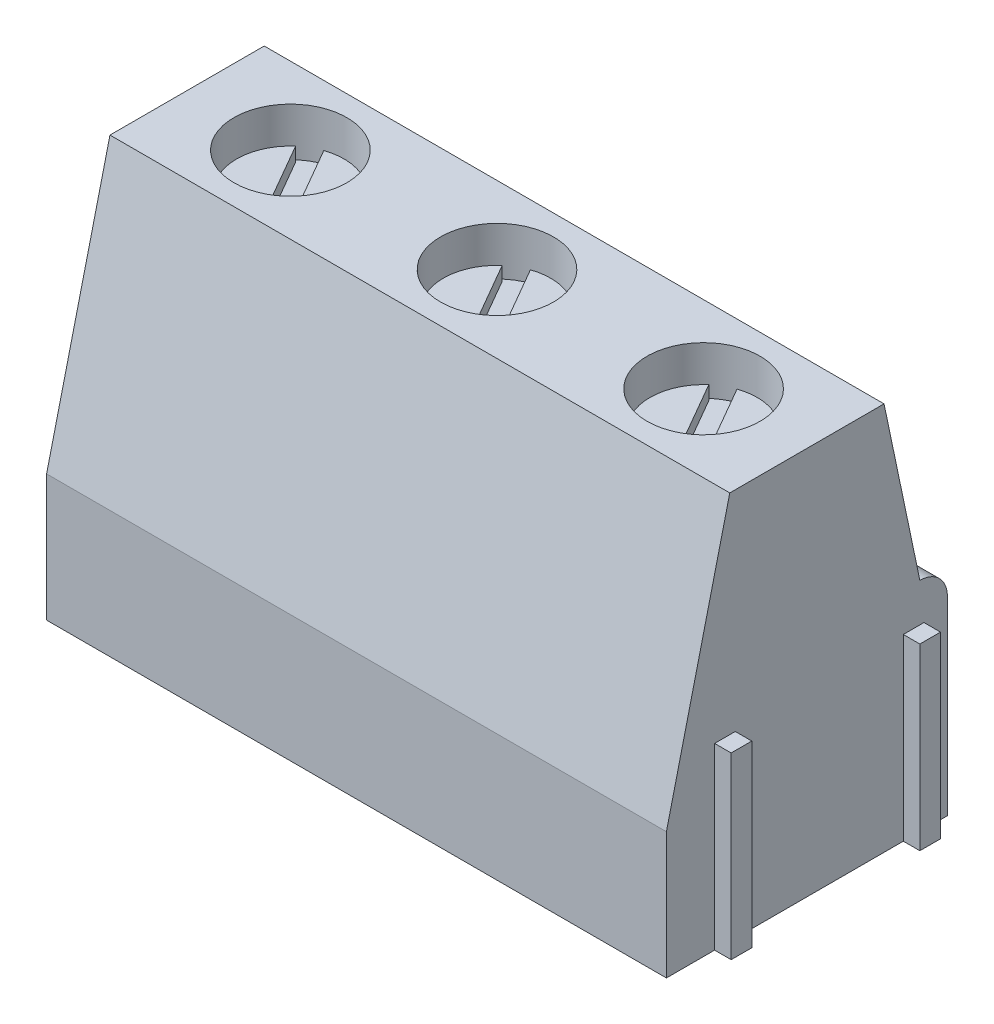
ISO-10303-21;
HEADER;
FILE_DESCRIPTION(('STEP AP214'),'2;1');
FILE_NAME('part.step','',(''),(''),'','','');
FILE_SCHEMA(('AUTOMOTIVE_DESIGN { 1 0 10303 214 1 1 1 1 }'));
ENDSEC;
DATA;
#1=APPLICATION_CONTEXT('core data for automotive mechanical design processes');
#2=APPLICATION_PROTOCOL_DEFINITION('international standard','automotive_design',2000,#1);
#3=PRODUCT_CONTEXT('',#1,'mechanical');
#4=PRODUCT('Part','Part','',(#3));
#5=PRODUCT_RELATED_PRODUCT_CATEGORY('part','',(#4));
#6=PRODUCT_DEFINITION_FORMATION('','',#4);
#7=PRODUCT_DEFINITION_CONTEXT('part definition',#1,'design');
#8=PRODUCT_DEFINITION('design','',#6,#7);
#9=PRODUCT_DEFINITION_SHAPE('','',#8);
#10=(LENGTH_UNIT() NAMED_UNIT(*) SI_UNIT(.MILLI.,.METRE.));
#11=(NAMED_UNIT(*) PLANE_ANGLE_UNIT() SI_UNIT($,.RADIAN.));
#12=(NAMED_UNIT(*) SI_UNIT($,.STERADIAN.) SOLID_ANGLE_UNIT());
#13=UNCERTAINTY_MEASURE_WITH_UNIT(LENGTH_MEASURE(1.E-05),#10,'distance_accuracy_value','');
#14=(GEOMETRIC_REPRESENTATION_CONTEXT(3) GLOBAL_UNCERTAINTY_ASSIGNED_CONTEXT((#13)) GLOBAL_UNIT_ASSIGNED_CONTEXT((#10,
#11,#12)) REPRESENTATION_CONTEXT('',''));
#15=CARTESIAN_POINT('',(0.,0.,0.));
#16=DIRECTION('',(0.,0.,1.));
#17=DIRECTION('',(1.,0.,0.));
#18=AXIS2_PLACEMENT_3D('',#15,#16,#17);
#19=CARTESIAN_POINT('',(7.5,12.85,0.));
#20=DIRECTION('',(0.,1.,0.));
#21=DIRECTION('',(0.,0.,1.));
#22=AXIS2_PLACEMENT_3D('',#19,#20,#21);
#23=CYLINDRICAL_SURFACE('',#22,2.05);
#24=CARTESIAN_POINT('',(7.5,14.1,0.));
#25=DIRECTION('',(0.,1.,0.));
#26=DIRECTION('',(0.,0.,1.));
#27=AXIS2_PLACEMENT_3D('',#24,#25,#26);
#28=CIRCLE('',#27,2.05);
#29=CARTESIAN_POINT('',(7.5,14.1,2.05));
#30=VERTEX_POINT('',#29);
#31=EDGE_CURVE('E10',#30,#30,#28,.T.);
#32=ORIENTED_EDGE('',*,*,#31,.T.);
#33=EDGE_LOOP('',(#32));
#34=FACE_BOUND('',#33,.T.);
#35=CARTESIAN_POINT('',(7.5,12.35,0.));
#36=DIRECTION('',(0.,1.,0.));
#37=DIRECTION('',(0.,0.,1.));
#38=AXIS2_PLACEMENT_3D('',#35,#36,#37);
#39=CIRCLE('',#38,2.05);
#40=CARTESIAN_POINT('',(7.5,12.35,2.05));
#41=VERTEX_POINT('',#40);
#42=EDGE_CURVE('E540',#41,#41,#39,.T.);
#43=ORIENTED_EDGE('',*,*,#42,.F.);
#44=EDGE_LOOP('',(#43));
#45=FACE_BOUND('',#44,.T.);
#46=ADVANCED_FACE('F16',(#34,#45),#23,.F.);
#47=CARTESIAN_POINT('',(7.5,12.35,0.));
#48=DIRECTION('',(0.,1.,0.));
#49=DIRECTION('',(0.,0.,1.));
#50=AXIS2_PLACEMENT_3D('',#47,#48,#49);
#51=CYLINDRICAL_SURFACE('',#50,1.95);
#52=CARTESIAN_POINT('',(7.5,12.35,0.));
#53=DIRECTION('',(0.,1.,0.));
#54=DIRECTION('',(0.,0.,1.));
#55=AXIS2_PLACEMENT_3D('',#52,#53,#54);
#56=CIRCLE('',#55,1.95);
#57=CARTESIAN_POINT('',(6.21843916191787,12.35,-1.46972848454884));
#58=VERTEX_POINT('',#57);
#59=CARTESIAN_POINT('',(8.13204178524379,12.35,1.84472848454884));
#60=VERTEX_POINT('',#59);
#61=EDGE_CURVE('E26',#58,#60,#56,.T.);
#62=ORIENTED_EDGE('',*,*,#61,.T.);
#63=DIRECTION('',(0.,1.,0.));
#64=VECTOR('',#63,1.);
#65=CARTESIAN_POINT('',(8.13204178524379,12.35,1.84472848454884));
#66=LINE('',#65,#64);
#67=CARTESIAN_POINT('',(8.13204178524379,12.85,1.84472848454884));
#68=VERTEX_POINT('',#67);
#69=EDGE_CURVE('E546',#60,#68,#66,.T.);
#70=ORIENTED_EDGE('',*,*,#69,.T.);
#71=CARTESIAN_POINT('',(7.5,12.85,0.));
#72=DIRECTION('',(0.,1.,0.));
#73=DIRECTION('',(0.,0.,1.));
#74=AXIS2_PLACEMENT_3D('',#71,#72,#73);
#75=CIRCLE('',#74,1.95);
#76=CARTESIAN_POINT('',(6.21843916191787,12.85,-1.46972848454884));
#77=VERTEX_POINT('',#76);
#78=EDGE_CURVE('E35',#77,#68,#75,.T.);
#79=ORIENTED_EDGE('',*,*,#78,.F.);
#80=DIRECTION('',(0.,1.,0.));
#81=VECTOR('',#80,1.);
#82=CARTESIAN_POINT('',(6.21843916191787,12.35,-1.46972848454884));
#83=LINE('',#82,#81);
#84=EDGE_CURVE('E545',#58,#77,#83,.T.);
#85=ORIENTED_EDGE('',*,*,#84,.F.);
#86=EDGE_LOOP('',(#62,#70,#79,#85));
#87=FACE_BOUND('',#86,.T.);
#88=ADVANCED_FACE('F814',(#87),#51,.T.);
#89=CARTESIAN_POINT('',(0.,12.35,0.));
#90=DIRECTION('',(0.,1.,0.));
#91=DIRECTION('',(0.,0.,1.));
#92=AXIS2_PLACEMENT_3D('',#89,#90,#91);
#93=CYLINDRICAL_SURFACE('',#92,1.95);
#94=CARTESIAN_POINT('',(0.,12.35,0.));
#95=DIRECTION('',(0.,1.,0.));
#96=DIRECTION('',(0.,0.,1.));
#97=AXIS2_PLACEMENT_3D('',#94,#95,#96);
#98=CIRCLE('',#97,1.95);
#99=CARTESIAN_POINT('',(-1.28156083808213,12.35,-1.46972848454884));
#100=VERTEX_POINT('',#99);
#101=CARTESIAN_POINT('',(0.632041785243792,12.35,1.84472848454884));
#102=VERTEX_POINT('',#101);
#103=EDGE_CURVE('E799',#100,#102,#98,.T.);
#104=ORIENTED_EDGE('',*,*,#103,.T.);
#105=DIRECTION('',(0.,1.,0.));
#106=VECTOR('',#105,1.);
#107=CARTESIAN_POINT('',(0.632041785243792,12.35,1.84472848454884));
#108=LINE('',#107,#106);
#109=CARTESIAN_POINT('',(0.632041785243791,12.85,1.84472848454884));
#110=VERTEX_POINT('',#109);
#111=EDGE_CURVE('E550',#102,#110,#108,.T.);
#112=ORIENTED_EDGE('',*,*,#111,.T.);
#113=CARTESIAN_POINT('',(0.,12.85,0.));
#114=DIRECTION('',(0.,1.,0.));
#115=DIRECTION('',(0.,0.,1.));
#116=AXIS2_PLACEMENT_3D('',#113,#114,#115);
#117=CIRCLE('',#116,1.95);
#118=CARTESIAN_POINT('',(-1.28156083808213,12.85,-1.46972848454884));
#119=VERTEX_POINT('',#118);
#120=EDGE_CURVE('E574',#119,#110,#117,.T.);
#121=ORIENTED_EDGE('',*,*,#120,.F.);
#122=DIRECTION('',(0.,1.,0.));
#123=VECTOR('',#122,1.);
#124=CARTESIAN_POINT('',(-1.28156083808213,12.35,-1.46972848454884));
#125=LINE('',#124,#123);
#126=EDGE_CURVE('E544',#100,#119,#125,.T.);
#127=ORIENTED_EDGE('',*,*,#126,.F.);
#128=EDGE_LOOP('',(#104,#112,#121,#127));
#129=FACE_BOUND('',#128,.T.);
#130=ADVANCED_FACE('F821',(#129),#93,.T.);
#131=CARTESIAN_POINT('',(0.,12.85,0.));
#132=DIRECTION('',(0.,1.,0.));
#133=DIRECTION('',(0.,0.,1.));
#134=AXIS2_PLACEMENT_3D('',#131,#132,#133);
#135=CYLINDRICAL_SURFACE('',#134,2.05);
#136=CARTESIAN_POINT('',(0.,14.1,0.));
#137=DIRECTION('',(0.,1.,0.));
#138=DIRECTION('',(0.,0.,1.));
#139=AXIS2_PLACEMENT_3D('',#136,#137,#138);
#140=CIRCLE('',#139,2.05);
#141=CARTESIAN_POINT('',(0.,14.1,2.05));
#142=VERTEX_POINT('',#141);
#143=EDGE_CURVE('E796',#142,#142,#140,.T.);
#144=ORIENTED_EDGE('',*,*,#143,.T.);
#145=EDGE_LOOP('',(#144));
#146=FACE_BOUND('',#145,.T.);
#147=CARTESIAN_POINT('',(0.,12.35,0.));
#148=DIRECTION('',(0.,1.,0.));
#149=DIRECTION('',(0.,0.,1.));
#150=AXIS2_PLACEMENT_3D('',#147,#148,#149);
#151=CIRCLE('',#150,2.05);
#152=CARTESIAN_POINT('',(0.,12.35,2.05));
#153=VERTEX_POINT('',#152);
#154=EDGE_CURVE('E553',#153,#153,#151,.T.);
#155=ORIENTED_EDGE('',*,*,#154,.F.);
#156=EDGE_LOOP('',(#155));
#157=FACE_BOUND('',#156,.T.);
#158=ADVANCED_FACE('F826',(#146,#157),#135,.F.);
#159=CARTESIAN_POINT('',(-7.5,12.35,0.));
#160=DIRECTION('',(0.,1.,0.));
#161=DIRECTION('',(0.,0.,1.));
#162=AXIS2_PLACEMENT_3D('',#159,#160,#161);
#163=CYLINDRICAL_SURFACE('',#162,1.95);
#164=CARTESIAN_POINT('',(-7.5,12.35,0.));
#165=DIRECTION('',(0.,1.,0.));
#166=DIRECTION('',(0.,0.,1.));
#167=AXIS2_PLACEMENT_3D('',#164,#165,#166);
#168=CIRCLE('',#167,1.95);
#169=CARTESIAN_POINT('',(-8.78156083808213,12.35,-1.46972848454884));
#170=VERTEX_POINT('',#169);
#171=CARTESIAN_POINT('',(-6.86795821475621,12.35,1.84472848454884));
#172=VERTEX_POINT('',#171);
#173=EDGE_CURVE('E789',#170,#172,#168,.T.);
#174=ORIENTED_EDGE('',*,*,#173,.T.);
#175=DIRECTION('',(0.,1.,0.));
#176=VECTOR('',#175,1.);
#177=CARTESIAN_POINT('',(-6.86795821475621,12.35,1.84472848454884));
#178=LINE('',#177,#176);
#179=CARTESIAN_POINT('',(-6.86795821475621,12.85,1.84472848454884));
#180=VERTEX_POINT('',#179);
#181=EDGE_CURVE('E631',#172,#180,#178,.T.);
#182=ORIENTED_EDGE('',*,*,#181,.T.);
#183=CARTESIAN_POINT('',(-7.5,12.85,0.));
#184=DIRECTION('',(0.,1.,0.));
#185=DIRECTION('',(0.,0.,1.));
#186=AXIS2_PLACEMENT_3D('',#183,#184,#185);
#187=CIRCLE('',#186,1.95);
#188=CARTESIAN_POINT('',(-8.78156083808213,12.85,-1.46972848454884));
#189=VERTEX_POINT('',#188);
#190=EDGE_CURVE('E630',#189,#180,#187,.T.);
#191=ORIENTED_EDGE('',*,*,#190,.F.);
#192=DIRECTION('',(0.,1.,0.));
#193=VECTOR('',#192,1.);
#194=CARTESIAN_POINT('',(-8.78156083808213,12.35,-1.46972848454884));
#195=LINE('',#194,#193);
#196=EDGE_CURVE('E639',#170,#189,#195,.T.);
#197=ORIENTED_EDGE('',*,*,#196,.F.);
#198=EDGE_LOOP('',(#174,#182,#191,#197));
#199=FACE_BOUND('',#198,.T.);
#200=ADVANCED_FACE('F830',(#199),#163,.T.);
#201=CARTESIAN_POINT('',(-7.5,12.85,0.));
#202=DIRECTION('',(0.,1.,0.));
#203=DIRECTION('',(0.,0.,1.));
#204=AXIS2_PLACEMENT_3D('',#201,#202,#203);
#205=CYLINDRICAL_SURFACE('',#204,2.05);
#206=CARTESIAN_POINT('',(-7.5,14.1,0.));
#207=DIRECTION('',(0.,1.,0.));
#208=DIRECTION('',(0.,0.,1.));
#209=AXIS2_PLACEMENT_3D('',#206,#207,#208);
#210=CIRCLE('',#209,2.05);
#211=CARTESIAN_POINT('',(-7.5,14.1,2.05));
#212=VERTEX_POINT('',#211);
#213=EDGE_CURVE('E784',#212,#212,#210,.T.);
#214=ORIENTED_EDGE('',*,*,#213,.T.);
#215=EDGE_LOOP('',(#214));
#216=FACE_BOUND('',#215,.T.);
#217=CARTESIAN_POINT('',(-7.5,12.35,0.));
#218=DIRECTION('',(0.,1.,0.));
#219=DIRECTION('',(0.,0.,1.));
#220=AXIS2_PLACEMENT_3D('',#217,#218,#219);
#221=CIRCLE('',#220,2.05);
#222=CARTESIAN_POINT('',(-7.5,12.35,2.05));
#223=VERTEX_POINT('',#222);
#224=EDGE_CURVE('E650',#223,#223,#221,.T.);
#225=ORIENTED_EDGE('',*,*,#224,.F.);
#226=EDGE_LOOP('',(#225));
#227=FACE_BOUND('',#226,.T.);
#228=ADVANCED_FACE('F834',(#216,#227),#205,.F.);
#229=CARTESIAN_POINT('',(11.25,14.1,5.1));
#230=DIRECTION('',(-1.,0.,0.));
#231=DIRECTION('',(0.,0.,1.));
#232=AXIS2_PLACEMENT_3D('',#229,#230,#231);
#233=PLANE('',#232);
#234=DIRECTION('',(0.,1.,0.));
#235=VECTOR('',#234,1.);
#236=CARTESIAN_POINT('',(11.25,0.,2.6));
#237=LINE('',#236,#235);
#238=CARTESIAN_POINT('',(11.25,0.,2.6));
#239=VERTEX_POINT('',#238);
#240=CARTESIAN_POINT('',(11.25,6.5,2.6));
#241=VERTEX_POINT('',#240);
#242=EDGE_CURVE('E414',#239,#241,#237,.T.);
#243=ORIENTED_EDGE('',*,*,#242,.F.);
#244=DIRECTION('',(0.,0.,-1.));
#245=VECTOR('',#244,1.);
#246=CARTESIAN_POINT('',(11.25,0.,5.1));
#247=LINE('',#246,#245);
#248=CARTESIAN_POINT('',(11.25,0.,-3.5));
#249=VERTEX_POINT('',#248);
#250=EDGE_CURVE('E777',#239,#249,#247,.T.);
#251=ORIENTED_EDGE('',*,*,#250,.T.);
#252=DIRECTION('',(0.,-1.,0.));
#253=VECTOR('',#252,1.);
#254=CARTESIAN_POINT('',(11.25,6.5,-3.5));
#255=LINE('',#254,#253);
#256=CARTESIAN_POINT('',(11.25,6.5,-3.5));
#257=VERTEX_POINT('',#256);
#258=EDGE_CURVE('E425',#257,#249,#255,.T.);
#259=ORIENTED_EDGE('',*,*,#258,.F.);
#260=DIRECTION('',(0.,0.,1.));
#261=VECTOR('',#260,1.);
#262=CARTESIAN_POINT('',(11.25,6.5,-4.25));
#263=LINE('',#262,#261);
#264=CARTESIAN_POINT('',(11.25,6.5,-4.25));
#265=VERTEX_POINT('',#264);
#266=EDGE_CURVE('E420',#265,#257,#263,.T.);
#267=ORIENTED_EDGE('',*,*,#266,.F.);
#268=DIRECTION('',(0.,1.,0.));
#269=VECTOR('',#268,1.);
#270=CARTESIAN_POINT('',(11.25,0.,-4.25));
#271=LINE('',#270,#269);
#272=CARTESIAN_POINT('',(11.25,0.,-4.25));
#273=VERTEX_POINT('',#272);
#274=EDGE_CURVE('E426',#273,#265,#271,.T.);
#275=ORIENTED_EDGE('',*,*,#274,.F.);
#276=DIRECTION('',(0.,0.,-1.));
#277=VECTOR('',#276,1.);
#278=CARTESIAN_POINT('',(11.25,0.,5.1));
#279=LINE('',#278,#277);
#280=CARTESIAN_POINT('',(11.25,0.,-5.1));
#281=VERTEX_POINT('',#280);
#282=EDGE_CURVE('E773',#273,#281,#279,.T.);
#283=ORIENTED_EDGE('',*,*,#282,.T.);
#284=DIRECTION('',(0.,-1.,0.));
#285=VECTOR('',#284,1.);
#286=CARTESIAN_POINT('',(11.25,14.1,-5.1));
#287=LINE('',#286,#285);
#288=CARTESIAN_POINT('',(11.25,6.9,-5.1));
#289=VERTEX_POINT('',#288);
#290=EDGE_CURVE('E695',#289,#281,#287,.T.);
#291=ORIENTED_EDGE('',*,*,#290,.F.);
#292=CARTESIAN_POINT('',(11.25,6.9,-4.1));
#293=DIRECTION('',(1.,0.,0.));
#294=DIRECTION('',(0.,0.,1.));
#295=AXIS2_PLACEMENT_3D('',#292,#293,#294);
#296=CIRCLE('',#295,1.);
#297=CARTESIAN_POINT('',(11.25,7.9,-4.1));
#298=VERTEX_POINT('',#297);
#299=EDGE_CURVE('E766',#289,#298,#296,.T.);
#300=ORIENTED_EDGE('',*,*,#299,.T.);
#301=DIRECTION('',(0.,-0.978716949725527,-0.205214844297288));
#302=VECTOR('',#301,1.);
#303=CARTESIAN_POINT('',(11.25,7.9,-4.1));
#304=LINE('',#303,#302);
#305=CARTESIAN_POINT('',(11.25,14.1,-2.8));
#306=VERTEX_POINT('',#305);
#307=EDGE_CURVE('E691',#306,#298,#304,.T.);
#308=ORIENTED_EDGE('',*,*,#307,.F.);
#309=DIRECTION('',(0.,0.,-1.));
#310=VECTOR('',#309,1.);
#311=CARTESIAN_POINT('',(11.25,14.1,5.1));
#312=LINE('',#311,#310);
#313=CARTESIAN_POINT('',(11.25,14.1,2.8));
#314=VERTEX_POINT('',#313);
#315=EDGE_CURVE('E696',#314,#306,#312,.T.);
#316=ORIENTED_EDGE('',*,*,#315,.F.);
#317=DIRECTION('',(0.,0.971921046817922,-0.235307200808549));
#318=VECTOR('',#317,1.);
#319=CARTESIAN_POINT('',(11.25,4.6,5.1));
#320=LINE('',#319,#318);
#321=CARTESIAN_POINT('',(11.25,4.6,5.1));
#322=VERTEX_POINT('',#321);
#323=EDGE_CURVE('E662',#322,#314,#320,.T.);
#324=ORIENTED_EDGE('',*,*,#323,.F.);
#325=DIRECTION('',(0.,-1.,0.));
#326=VECTOR('',#325,1.);
#327=CARTESIAN_POINT('',(11.25,14.1,5.1));
#328=LINE('',#327,#326);
#329=CARTESIAN_POINT('',(11.25,0.,5.1));
#330=VERTEX_POINT('',#329);
#331=EDGE_CURVE('E763',#322,#330,#328,.T.);
#332=ORIENTED_EDGE('',*,*,#331,.T.);
#333=DIRECTION('',(0.,0.,-1.));
#334=VECTOR('',#333,1.);
#335=CARTESIAN_POINT('',(11.25,0.,5.1));
#336=LINE('',#335,#334);
#337=CARTESIAN_POINT('',(11.25,0.,3.35));
#338=VERTEX_POINT('',#337);
#339=EDGE_CURVE('E754',#330,#338,#336,.T.);
#340=ORIENTED_EDGE('',*,*,#339,.T.);
#341=DIRECTION('',(0.,-1.,0.));
#342=VECTOR('',#341,1.);
#343=CARTESIAN_POINT('',(11.25,6.5,3.35));
#344=LINE('',#343,#342);
#345=CARTESIAN_POINT('',(11.25,6.5,3.35));
#346=VERTEX_POINT('',#345);
#347=EDGE_CURVE('E403',#346,#338,#344,.T.);
#348=ORIENTED_EDGE('',*,*,#347,.F.);
#349=DIRECTION('',(0.,0.,1.));
#350=VECTOR('',#349,1.);
#351=CARTESIAN_POINT('',(11.25,6.5,2.6));
#352=LINE('',#351,#350);
#353=EDGE_CURVE('E409',#241,#346,#352,.T.);
#354=ORIENTED_EDGE('',*,*,#353,.F.);
#355=EDGE_LOOP('',(#243,#251,#259,#267,#275,#283,#291,#300,#308,#316,#324,#332,#340,#348,#354));
#356=FACE_BOUND('',#355,.T.);
#357=ADVANCED_FACE('F838',(#356),#233,.F.);
#358=CARTESIAN_POINT('',(-11.25,14.1,5.1));
#359=DIRECTION('',(1.,0.,0.));
#360=DIRECTION('',(0.,0.,-1.));
#361=AXIS2_PLACEMENT_3D('',#358,#359,#360);
#362=PLANE('',#361);
#363=DIRECTION('',(0.,0.,-1.));
#364=VECTOR('',#363,1.);
#365=CARTESIAN_POINT('',(-11.25,6.5,3.35));
#366=LINE('',#365,#364);
#367=CARTESIAN_POINT('',(-11.25,6.5,3.35));
#368=VERTEX_POINT('',#367);
#369=CARTESIAN_POINT('',(-11.25,6.5,2.6));
#370=VERTEX_POINT('',#369);
#371=EDGE_CURVE('E367',#368,#370,#366,.T.);
#372=ORIENTED_EDGE('',*,*,#371,.F.);
#373=DIRECTION('',(0.,1.,0.));
#374=VECTOR('',#373,1.);
#375=CARTESIAN_POINT('',(-11.25,0.,3.35));
#376=LINE('',#375,#374);
#377=CARTESIAN_POINT('',(-11.25,0.,3.35));
#378=VERTEX_POINT('',#377);
#379=EDGE_CURVE('E393',#378,#368,#376,.T.);
#380=ORIENTED_EDGE('',*,*,#379,.F.);
#381=DIRECTION('',(0.,0.,1.));
#382=VECTOR('',#381,1.);
#383=CARTESIAN_POINT('',(-11.25,0.,5.1));
#384=LINE('',#383,#382);
#385=CARTESIAN_POINT('',(-11.25,0.,5.1));
#386=VERTEX_POINT('',#385);
#387=EDGE_CURVE('E750',#378,#386,#384,.T.);
#388=ORIENTED_EDGE('',*,*,#387,.T.);
#389=DIRECTION('',(0.,-1.,0.));
#390=VECTOR('',#389,1.);
#391=CARTESIAN_POINT('',(-11.25,14.1,5.1));
#392=LINE('',#391,#390);
#393=CARTESIAN_POINT('',(-11.25,4.6,5.1));
#394=VERTEX_POINT('',#393);
#395=EDGE_CURVE('E723',#394,#386,#392,.T.);
#396=ORIENTED_EDGE('',*,*,#395,.F.);
#397=DIRECTION('',(0.,0.971921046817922,-0.235307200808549));
#398=VECTOR('',#397,1.);
#399=CARTESIAN_POINT('',(-11.25,4.6,5.1));
#400=LINE('',#399,#398);
#401=CARTESIAN_POINT('',(-11.25,14.1,2.8));
#402=VERTEX_POINT('',#401);
#403=EDGE_CURVE('E746',#394,#402,#400,.T.);
#404=ORIENTED_EDGE('',*,*,#403,.T.);
#405=DIRECTION('',(0.,0.,1.));
#406=VECTOR('',#405,1.);
#407=CARTESIAN_POINT('',(-11.25,14.1,5.1));
#408=LINE('',#407,#406);
#409=CARTESIAN_POINT('',(-11.25,14.1,-2.8));
#410=VERTEX_POINT('',#409);
#411=EDGE_CURVE('E688',#410,#402,#408,.T.);
#412=ORIENTED_EDGE('',*,*,#411,.F.);
#413=DIRECTION('',(0.,-0.978716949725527,-0.205214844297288));
#414=VECTOR('',#413,1.);
#415=CARTESIAN_POINT('',(-11.25,7.9,-4.1));
#416=LINE('',#415,#414);
#417=CARTESIAN_POINT('',(-11.25,7.9,-4.1));
#418=VERTEX_POINT('',#417);
#419=EDGE_CURVE('E743',#410,#418,#416,.T.);
#420=ORIENTED_EDGE('',*,*,#419,.T.);
#421=CARTESIAN_POINT('',(-11.25,6.9,-4.1));
#422=DIRECTION('',(-1.,0.,0.));
#423=DIRECTION('',(0.,0.,-1.));
#424=AXIS2_PLACEMENT_3D('',#421,#422,#423);
#425=CIRCLE('',#424,1.);
#426=CARTESIAN_POINT('',(-11.25,6.9,-5.1));
#427=VERTEX_POINT('',#426);
#428=EDGE_CURVE('E740',#418,#427,#425,.T.);
#429=ORIENTED_EDGE('',*,*,#428,.T.);
#430=DIRECTION('',(0.,-1.,0.));
#431=VECTOR('',#430,1.);
#432=CARTESIAN_POINT('',(-11.25,14.1,-5.1));
#433=LINE('',#432,#431);
#434=CARTESIAN_POINT('',(-11.25,0.,-5.1));
#435=VERTEX_POINT('',#434);
#436=EDGE_CURVE('E737',#427,#435,#433,.T.);
#437=ORIENTED_EDGE('',*,*,#436,.T.);
#438=DIRECTION('',(0.,0.,1.));
#439=VECTOR('',#438,1.);
#440=CARTESIAN_POINT('',(-11.25,0.,5.1));
#441=LINE('',#440,#439);
#442=CARTESIAN_POINT('',(-11.25,0.,-4.25));
#443=VERTEX_POINT('',#442);
#444=EDGE_CURVE('E731',#435,#443,#441,.T.);
#445=ORIENTED_EDGE('',*,*,#444,.T.);
#446=DIRECTION('',(0.,-1.,0.));
#447=VECTOR('',#446,1.);
#448=CARTESIAN_POINT('',(-11.25,6.5,-4.25));
#449=LINE('',#448,#447);
#450=CARTESIAN_POINT('',(-11.25,6.5,-4.25));
#451=VERTEX_POINT('',#450);
#452=EDGE_CURVE('E390',#451,#443,#449,.T.);
#453=ORIENTED_EDGE('',*,*,#452,.F.);
#454=DIRECTION('',(0.,0.,-1.));
#455=VECTOR('',#454,1.);
#456=CARTESIAN_POINT('',(-11.25,6.5,-3.5));
#457=LINE('',#456,#455);
#458=CARTESIAN_POINT('',(-11.25,6.5,-3.5));
#459=VERTEX_POINT('',#458);
#460=EDGE_CURVE('E382',#459,#451,#457,.T.);
#461=ORIENTED_EDGE('',*,*,#460,.F.);
#462=DIRECTION('',(0.,1.,0.));
#463=VECTOR('',#462,1.);
#464=CARTESIAN_POINT('',(-11.25,0.,-3.5));
#465=LINE('',#464,#463);
#466=CARTESIAN_POINT('',(-11.25,0.,-3.5));
#467=VERTEX_POINT('',#466);
#468=EDGE_CURVE('E383',#467,#459,#465,.T.);
#469=ORIENTED_EDGE('',*,*,#468,.F.);
#470=DIRECTION('',(0.,0.,1.));
#471=VECTOR('',#470,1.);
#472=CARTESIAN_POINT('',(-11.25,0.,5.1));
#473=LINE('',#472,#471);
#474=CARTESIAN_POINT('',(-11.25,0.,2.6));
#475=VERTEX_POINT('',#474);
#476=EDGE_CURVE('E728',#467,#475,#473,.T.);
#477=ORIENTED_EDGE('',*,*,#476,.T.);
#478=DIRECTION('',(0.,-1.,0.));
#479=VECTOR('',#478,1.);
#480=CARTESIAN_POINT('',(-11.25,6.5,2.6));
#481=LINE('',#480,#479);
#482=EDGE_CURVE('E369',#370,#475,#481,.T.);
#483=ORIENTED_EDGE('',*,*,#482,.F.);
#484=EDGE_LOOP('',(#372,#380,#388,#396,#404,#412,#420,#429,#437,#445,#453,#461,#469,#477,#483));
#485=FACE_BOUND('',#484,.T.);
#486=ADVANCED_FACE('F842',(#485),#362,.F.);
#487=CARTESIAN_POINT('',(-11.25,14.1,5.1));
#488=DIRECTION('',(0.,0.,-1.));
#489=DIRECTION('',(-1.,0.,0.));
#490=AXIS2_PLACEMENT_3D('',#487,#488,#489);
#491=PLANE('',#490);
#492=ORIENTED_EDGE('',*,*,#331,.F.);
#493=DIRECTION('',(1.,0.,0.));
#494=VECTOR('',#493,1.);
#495=CARTESIAN_POINT('',(-11.25,4.6,5.1));
#496=LINE('',#495,#494);
#497=EDGE_CURVE('E724',#394,#322,#496,.T.);
#498=ORIENTED_EDGE('',*,*,#497,.F.);
#499=ORIENTED_EDGE('',*,*,#395,.T.);
#500=DIRECTION('',(1.,0.,0.));
#501=VECTOR('',#500,1.);
#502=CARTESIAN_POINT('',(-11.25,0.,5.1));
#503=LINE('',#502,#501);
#504=EDGE_CURVE('E700',#386,#330,#503,.T.);
#505=ORIENTED_EDGE('',*,*,#504,.T.);
#506=EDGE_LOOP('',(#492,#498,#499,#505));
#507=FACE_BOUND('',#506,.T.);
#508=ADVANCED_FACE('F846',(#507),#491,.F.);
#509=CARTESIAN_POINT('',(-11.25,14.1,-5.1));
#510=DIRECTION('',(0.,0.,1.));
#511=DIRECTION('',(1.,0.,0.));
#512=AXIS2_PLACEMENT_3D('',#509,#510,#511);
#513=PLANE('',#512);
#514=DIRECTION('',(1.,0.,0.));
#515=VECTOR('',#514,1.);
#516=CARTESIAN_POINT('',(5.8,6.5,-5.1));
#517=LINE('',#516,#515);
#518=CARTESIAN_POINT('',(5.8,6.5,-5.1));
#519=VERTEX_POINT('',#518);
#520=CARTESIAN_POINT('',(9.2,6.5,-5.1));
#521=VERTEX_POINT('',#520);
#522=EDGE_CURVE('E493',#519,#521,#517,.T.);
#523=ORIENTED_EDGE('',*,*,#522,.F.);
#524=DIRECTION('',(0.,1.,0.));
#525=VECTOR('',#524,1.);
#526=CARTESIAN_POINT('',(5.8,6.5,-5.1));
#527=LINE('',#526,#525);
#528=CARTESIAN_POINT('',(5.8,1.6,-5.1));
#529=VERTEX_POINT('',#528);
#530=EDGE_CURVE('E709',#529,#519,#527,.T.);
#531=ORIENTED_EDGE('',*,*,#530,.F.);
#532=DIRECTION('',(-1.,0.,0.));
#533=VECTOR('',#532,1.);
#534=CARTESIAN_POINT('',(5.8,1.6,-5.1));
#535=LINE('',#534,#533);
#536=CARTESIAN_POINT('',(9.2,1.6,-5.1));
#537=VERTEX_POINT('',#536);
#538=EDGE_CURVE('E506',#537,#529,#535,.T.);
#539=ORIENTED_EDGE('',*,*,#538,.F.);
#540=DIRECTION('',(0.,-1.,0.));
#541=VECTOR('',#540,1.);
#542=CARTESIAN_POINT('',(9.2,1.6,-5.1));
#543=LINE('',#542,#541);
#544=EDGE_CURVE('E488',#521,#537,#543,.T.);
#545=ORIENTED_EDGE('',*,*,#544,.F.);
#546=EDGE_LOOP('',(#523,#531,#539,#545));
#547=FACE_BOUND('',#546,.T.);
#548=DIRECTION('',(1.,0.,0.));
#549=VECTOR('',#548,1.);
#550=CARTESIAN_POINT('',(-1.7,6.5,-5.1));
#551=LINE('',#550,#549);
#552=CARTESIAN_POINT('',(-1.7,6.5,-5.1));
#553=VERTEX_POINT('',#552);
#554=CARTESIAN_POINT('',(1.7,6.5,-5.1));
#555=VERTEX_POINT('',#554);
#556=EDGE_CURVE('E510',#553,#555,#551,.T.);
#557=ORIENTED_EDGE('',*,*,#556,.F.);
#558=DIRECTION('',(0.,1.,0.));
#559=VECTOR('',#558,1.);
#560=CARTESIAN_POINT('',(-1.7,6.5,-5.1));
#561=LINE('',#560,#559);
#562=CARTESIAN_POINT('',(-1.7,1.6,-5.1));
#563=VERTEX_POINT('',#562);
#564=EDGE_CURVE('E494',#563,#553,#561,.T.);
#565=ORIENTED_EDGE('',*,*,#564,.F.);
#566=DIRECTION('',(-1.,0.,0.));
#567=VECTOR('',#566,1.);
#568=CARTESIAN_POINT('',(-1.7,1.6,-5.1));
#569=LINE('',#568,#567);
#570=CARTESIAN_POINT('',(1.7,1.6,-5.1));
#571=VERTEX_POINT('',#570);
#572=EDGE_CURVE('E522',#571,#563,#569,.T.);
#573=ORIENTED_EDGE('',*,*,#572,.F.);
#574=DIRECTION('',(0.,-1.,0.));
#575=VECTOR('',#574,1.);
#576=CARTESIAN_POINT('',(1.7,1.6,-5.1));
#577=LINE('',#576,#575);
#578=EDGE_CURVE('E707',#555,#571,#577,.T.);
#579=ORIENTED_EDGE('',*,*,#578,.F.);
#580=EDGE_LOOP('',(#557,#565,#573,#579));
#581=FACE_BOUND('',#580,.T.);
#582=DIRECTION('',(1.,0.,0.));
#583=VECTOR('',#582,1.);
#584=CARTESIAN_POINT('',(-9.2,6.5,-5.1));
#585=LINE('',#584,#583);
#586=CARTESIAN_POINT('',(-9.2,6.5,-5.1));
#587=VERTEX_POINT('',#586);
#588=CARTESIAN_POINT('',(-5.8,6.5,-5.1));
#589=VERTEX_POINT('',#588);
#590=EDGE_CURVE('E612',#587,#589,#585,.T.);
#591=ORIENTED_EDGE('',*,*,#590,.F.);
#592=DIRECTION('',(0.,1.,0.));
#593=VECTOR('',#592,1.);
#594=CARTESIAN_POINT('',(-9.2,6.5,-5.1));
#595=LINE('',#594,#593);
#596=CARTESIAN_POINT('',(-9.2,1.6,-5.1));
#597=VERTEX_POINT('',#596);
#598=EDGE_CURVE('E613',#597,#587,#595,.T.);
#599=ORIENTED_EDGE('',*,*,#598,.F.);
#600=DIRECTION('',(-1.,0.,0.));
#601=VECTOR('',#600,1.);
#602=CARTESIAN_POINT('',(-9.2,1.6,-5.1));
#603=LINE('',#602,#601);
#604=CARTESIAN_POINT('',(-5.8,1.6,-5.1));
#605=VERTEX_POINT('',#604);
#606=EDGE_CURVE('E625',#605,#597,#603,.T.);
#607=ORIENTED_EDGE('',*,*,#606,.F.);
#608=DIRECTION('',(0.,-1.,0.));
#609=VECTOR('',#608,1.);
#610=CARTESIAN_POINT('',(-5.8,1.6,-5.1));
#611=LINE('',#610,#609);
#612=EDGE_CURVE('E607',#589,#605,#611,.T.);
#613=ORIENTED_EDGE('',*,*,#612,.F.);
#614=EDGE_LOOP('',(#591,#599,#607,#613));
#615=FACE_BOUND('',#614,.T.);
#616=ORIENTED_EDGE('',*,*,#436,.F.);
#617=DIRECTION('',(1.,0.,0.));
#618=VECTOR('',#617,1.);
#619=CARTESIAN_POINT('',(-11.25,6.9,-5.1));
#620=LINE('',#619,#618);
#621=EDGE_CURVE('E697',#427,#289,#620,.T.);
#622=ORIENTED_EDGE('',*,*,#621,.T.);
#623=ORIENTED_EDGE('',*,*,#290,.T.);
#624=DIRECTION('',(-1.,0.,0.));
#625=VECTOR('',#624,1.);
#626=CARTESIAN_POINT('',(-11.25,0.,-5.1));
#627=LINE('',#626,#625);
#628=EDGE_CURVE('E692',#281,#435,#627,.T.);
#629=ORIENTED_EDGE('',*,*,#628,.T.);
#630=EDGE_LOOP('',(#616,#622,#623,#629));
#631=FACE_BOUND('',#630,.T.);
#632=ADVANCED_FACE('F850',(#547,#581,#615,#631),#513,.F.);
#633=CARTESIAN_POINT('',(-11.25,14.1,-5.1));
#634=DIRECTION('',(0.,-1.,0.));
#635=DIRECTION('',(0.,0.,-1.));
#636=AXIS2_PLACEMENT_3D('',#633,#634,#635);
#637=PLANE('',#636);
#638=ORIENTED_EDGE('',*,*,#143,.F.);
#639=EDGE_LOOP('',(#638));
#640=FACE_BOUND('',#639,.T.);
#641=ORIENTED_EDGE('',*,*,#213,.F.);
#642=EDGE_LOOP('',(#641));
#643=FACE_BOUND('',#642,.T.);
#644=ORIENTED_EDGE('',*,*,#315,.T.);
#645=DIRECTION('',(1.,0.,0.));
#646=VECTOR('',#645,1.);
#647=CARTESIAN_POINT('',(-11.25,14.1,-2.8));
#648=LINE('',#647,#646);
#649=EDGE_CURVE('E657',#410,#306,#648,.T.);
#650=ORIENTED_EDGE('',*,*,#649,.F.);
#651=ORIENTED_EDGE('',*,*,#411,.T.);
#652=DIRECTION('',(1.,0.,0.));
#653=VECTOR('',#652,1.);
#654=CARTESIAN_POINT('',(-11.25,14.1,2.8));
#655=LINE('',#654,#653);
#656=EDGE_CURVE('E681',#402,#314,#655,.T.);
#657=ORIENTED_EDGE('',*,*,#656,.T.);
#658=EDGE_LOOP('',(#644,#650,#651,#657));
#659=FACE_BOUND('',#658,.T.);
#660=ORIENTED_EDGE('',*,*,#31,.F.);
#661=EDGE_LOOP('',(#660));
#662=FACE_BOUND('',#661,.T.);
#663=ADVANCED_FACE('F854',(#640,#643,#659,#662),#637,.F.);
#664=CARTESIAN_POINT('',(-11.25,0.,-5.1));
#665=DIRECTION('',(0.,-1.,0.));
#666=DIRECTION('',(0.,0.,-1.));
#667=AXIS2_PLACEMENT_3D('',#664,#665,#666);
#668=PLANE('',#667);
#669=DIRECTION('',(-1.,0.,0.));
#670=VECTOR('',#669,1.);
#671=CARTESIAN_POINT('',(-10.65,0.,3.35));
#672=LINE('',#671,#670);
#673=CARTESIAN_POINT('',(-10.65,0.,3.35));
#674=VERTEX_POINT('',#673);
#675=EDGE_CURVE('E683',#674,#378,#672,.T.);
#676=ORIENTED_EDGE('',*,*,#675,.F.);
#677=DIRECTION('',(0.,0.,1.));
#678=VECTOR('',#677,1.);
#679=CARTESIAN_POINT('',(-10.65,0.,2.6));
#680=LINE('',#679,#678);
#681=CARTESIAN_POINT('',(-10.65,0.,2.6));
#682=VERTEX_POINT('',#681);
#683=EDGE_CURVE('E361',#682,#674,#680,.T.);
#684=ORIENTED_EDGE('',*,*,#683,.F.);
#685=DIRECTION('',(-1.,0.,0.));
#686=VECTOR('',#685,1.);
#687=CARTESIAN_POINT('',(-10.65,0.,2.6));
#688=LINE('',#687,#686);
#689=EDGE_CURVE('E360',#682,#475,#688,.T.);
#690=ORIENTED_EDGE('',*,*,#689,.T.);
#691=ORIENTED_EDGE('',*,*,#476,.F.);
#692=DIRECTION('',(-1.,0.,0.));
#693=VECTOR('',#692,1.);
#694=CARTESIAN_POINT('',(-10.65,0.,-3.5));
#695=LINE('',#694,#693);
#696=CARTESIAN_POINT('',(-10.65,0.,-3.5));
#697=VERTEX_POINT('',#696);
#698=EDGE_CURVE('E677',#697,#467,#695,.T.);
#699=ORIENTED_EDGE('',*,*,#698,.F.);
#700=DIRECTION('',(0.,0.,1.));
#701=VECTOR('',#700,1.);
#702=CARTESIAN_POINT('',(-10.65,0.,-4.25));
#703=LINE('',#702,#701);
#704=CARTESIAN_POINT('',(-10.65,0.,-4.25));
#705=VERTEX_POINT('',#704);
#706=EDGE_CURVE('E377',#705,#697,#703,.T.);
#707=ORIENTED_EDGE('',*,*,#706,.F.);
#708=DIRECTION('',(-1.,0.,0.));
#709=VECTOR('',#708,1.);
#710=CARTESIAN_POINT('',(-10.65,0.,-4.25));
#711=LINE('',#710,#709);
#712=EDGE_CURVE('E669',#705,#443,#711,.T.);
#713=ORIENTED_EDGE('',*,*,#712,.T.);
#714=ORIENTED_EDGE('',*,*,#444,.F.);
#715=ORIENTED_EDGE('',*,*,#628,.F.);
#716=ORIENTED_EDGE('',*,*,#282,.F.);
#717=DIRECTION('',(-1.,0.,0.));
#718=VECTOR('',#717,1.);
#719=CARTESIAN_POINT('',(11.85,0.,-4.25));
#720=LINE('',#719,#718);
#721=CARTESIAN_POINT('',(11.85,0.,-4.25));
#722=VERTEX_POINT('',#721);
#723=EDGE_CURVE('E671',#722,#273,#720,.T.);
#724=ORIENTED_EDGE('',*,*,#723,.F.);
#725=DIRECTION('',(0.,0.,-1.));
#726=VECTOR('',#725,1.);
#727=CARTESIAN_POINT('',(11.85,0.,-4.25));
#728=LINE('',#727,#726);
#729=CARTESIAN_POINT('',(11.85,0.,-3.5));
#730=VERTEX_POINT('',#729);
#731=EDGE_CURVE('E416',#730,#722,#728,.T.);
#732=ORIENTED_EDGE('',*,*,#731,.F.);
#733=DIRECTION('',(-1.,0.,0.));
#734=VECTOR('',#733,1.);
#735=CARTESIAN_POINT('',(11.85,0.,-3.5));
#736=LINE('',#735,#734);
#737=EDGE_CURVE('E661',#730,#249,#736,.T.);
#738=ORIENTED_EDGE('',*,*,#737,.T.);
#739=ORIENTED_EDGE('',*,*,#250,.F.);
#740=DIRECTION('',(-1.,0.,0.));
#741=VECTOR('',#740,1.);
#742=CARTESIAN_POINT('',(11.85,0.,2.6));
#743=LINE('',#742,#741);
#744=CARTESIAN_POINT('',(11.85,0.,2.6));
#745=VERTEX_POINT('',#744);
#746=EDGE_CURVE('E664',#745,#239,#743,.T.);
#747=ORIENTED_EDGE('',*,*,#746,.F.);
#748=DIRECTION('',(0.,0.,-1.));
#749=VECTOR('',#748,1.);
#750=CARTESIAN_POINT('',(11.85,0.,3.35));
#751=LINE('',#750,#749);
#752=CARTESIAN_POINT('',(11.85,0.,3.35));
#753=VERTEX_POINT('',#752);
#754=EDGE_CURVE('E404',#753,#745,#751,.T.);
#755=ORIENTED_EDGE('',*,*,#754,.F.);
#756=DIRECTION('',(-1.,0.,0.));
#757=VECTOR('',#756,1.);
#758=CARTESIAN_POINT('',(11.85,0.,3.35));
#759=LINE('',#758,#757);
#760=EDGE_CURVE('E658',#753,#338,#759,.T.);
#761=ORIENTED_EDGE('',*,*,#760,.T.);
#762=ORIENTED_EDGE('',*,*,#339,.F.);
#763=ORIENTED_EDGE('',*,*,#504,.F.);
#764=ORIENTED_EDGE('',*,*,#387,.F.);
#765=EDGE_LOOP('',(#676,#684,#690,#691,#699,#707,#713,#714,#715,#716,#724,#732,#738,#739,#747,
#755,#761,#762,#763,#764));
#766=FACE_BOUND('',#765,.T.);
#767=ADVANCED_FACE('F858',(#766),#668,.T.);
#768=CARTESIAN_POINT('',(-11.25,4.6,5.1));
#769=DIRECTION('',(0.,-0.235307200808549,-0.971921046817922));
#770=DIRECTION('',(0.,0.971921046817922,-0.235307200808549));
#771=AXIS2_PLACEMENT_3D('',#768,#769,#770);
#772=PLANE('',#771);
#773=ORIENTED_EDGE('',*,*,#323,.T.);
#774=ORIENTED_EDGE('',*,*,#656,.F.);
#775=ORIENTED_EDGE('',*,*,#403,.F.);
#776=ORIENTED_EDGE('',*,*,#497,.T.);
#777=EDGE_LOOP('',(#773,#774,#775,#776));
#778=FACE_BOUND('',#777,.T.);
#779=ADVANCED_FACE('F862',(#778),#772,.F.);
#780=CARTESIAN_POINT('',(-11.25,7.9,-4.1));
#781=DIRECTION('',(0.,-0.205214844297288,0.978716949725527));
#782=DIRECTION('',(0.,-0.978716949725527,-0.205214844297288));
#783=AXIS2_PLACEMENT_3D('',#780,#781,#782);
#784=PLANE('',#783);
#785=ORIENTED_EDGE('',*,*,#307,.T.);
#786=DIRECTION('',(1.,0.,0.));
#787=VECTOR('',#786,1.);
#788=CARTESIAN_POINT('',(-11.25,7.9,-4.1));
#789=LINE('',#788,#787);
#790=EDGE_CURVE('E654',#418,#298,#789,.T.);
#791=ORIENTED_EDGE('',*,*,#790,.F.);
#792=ORIENTED_EDGE('',*,*,#419,.F.);
#793=ORIENTED_EDGE('',*,*,#649,.T.);
#794=EDGE_LOOP('',(#785,#791,#792,#793));
#795=FACE_BOUND('',#794,.T.);
#796=ADVANCED_FACE('F866',(#795),#784,.F.);
#797=CARTESIAN_POINT('',(-11.25,6.9,-4.1));
#798=DIRECTION('',(1.,0.,0.));
#799=DIRECTION('',(0.,0.,-1.));
#800=AXIS2_PLACEMENT_3D('',#797,#798,#799);
#801=CYLINDRICAL_SURFACE('',#800,1.);
#802=ORIENTED_EDGE('',*,*,#428,.F.);
#803=ORIENTED_EDGE('',*,*,#790,.T.);
#804=ORIENTED_EDGE('',*,*,#299,.F.);
#805=ORIENTED_EDGE('',*,*,#621,.F.);
#806=EDGE_LOOP('',(#802,#803,#804,#805));
#807=FACE_BOUND('',#806,.T.);
#808=ADVANCED_FACE('F870',(#807),#801,.T.);
#809=CARTESIAN_POINT('',(-7.5,12.35,0.));
#810=DIRECTION('',(0.,1.,0.));
#811=DIRECTION('',(0.,0.,1.));
#812=AXIS2_PLACEMENT_3D('',#809,#810,#811);
#813=PLANE('',#812);
#814=DIRECTION('',(-0.499999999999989,0.,-0.866025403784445));
#815=VECTOR('',#814,1.);
#816=CARTESIAN_POINT('',(-8.78156083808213,12.35,-1.46972848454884));
#817=LINE('',#816,#815);
#818=EDGE_CURVE('E635',#172,#170,#817,.T.);
#819=ORIENTED_EDGE('',*,*,#818,.F.);
#820=ORIENTED_EDGE('',*,*,#173,.F.);
#821=EDGE_LOOP('',(#819,#820));
#822=FACE_BOUND('',#821,.T.);
#823=DIRECTION('',(0.499999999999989,0.,0.866025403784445));
#824=VECTOR('',#823,1.);
#825=CARTESIAN_POINT('',(-8.1320417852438,12.35,-1.84472848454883));
#826=LINE('',#825,#824);
#827=CARTESIAN_POINT('',(-8.1320417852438,12.35,-1.84472848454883));
#828=VERTEX_POINT('',#827);
#829=CARTESIAN_POINT('',(-6.21843916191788,12.35,1.46972848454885));
#830=VERTEX_POINT('',#829);
#831=EDGE_CURVE('E644',#828,#830,#826,.T.);
#832=ORIENTED_EDGE('',*,*,#831,.F.);
#833=CARTESIAN_POINT('',(-7.5,12.35,0.));
#834=DIRECTION('',(0.,1.,0.));
#835=DIRECTION('',(0.,0.,1.));
#836=AXIS2_PLACEMENT_3D('',#833,#834,#835);
#837=CIRCLE('',#836,1.95);
#838=EDGE_CURVE('E643',#830,#828,#837,.T.);
#839=ORIENTED_EDGE('',*,*,#838,.F.);
#840=EDGE_LOOP('',(#832,#839));
#841=FACE_BOUND('',#840,.T.);
#842=ORIENTED_EDGE('',*,*,#224,.T.);
#843=EDGE_LOOP('',(#842));
#844=FACE_BOUND('',#843,.T.);
#845=ADVANCED_FACE('F874',(#822,#841,#844),#813,.T.);
#846=CARTESIAN_POINT('',(-7.5,12.35,0.));
#847=DIRECTION('',(0.,1.,0.));
#848=DIRECTION('',(0.,0.,1.));
#849=AXIS2_PLACEMENT_3D('',#846,#847,#848);
#850=CYLINDRICAL_SURFACE('',#849,1.95);
#851=CARTESIAN_POINT('',(-7.5,12.85,0.));
#852=DIRECTION('',(0.,1.,0.));
#853=DIRECTION('',(0.,0.,1.));
#854=AXIS2_PLACEMENT_3D('',#851,#852,#853);
#855=CIRCLE('',#854,1.95);
#856=CARTESIAN_POINT('',(-6.21843916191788,12.85,1.46972848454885));
#857=VERTEX_POINT('',#856);
#858=CARTESIAN_POINT('',(-8.1320417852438,12.85,-1.84472848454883));
#859=VERTEX_POINT('',#858);
#860=EDGE_CURVE('E629',#857,#859,#855,.T.);
#861=ORIENTED_EDGE('',*,*,#860,.F.);
#862=DIRECTION('',(0.,1.,0.));
#863=VECTOR('',#862,1.);
#864=CARTESIAN_POINT('',(-6.21843916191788,12.35,1.46972848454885));
#865=LINE('',#864,#863);
#866=EDGE_CURVE('E634',#830,#857,#865,.T.);
#867=ORIENTED_EDGE('',*,*,#866,.F.);
#868=ORIENTED_EDGE('',*,*,#838,.T.);
#869=DIRECTION('',(0.,1.,0.));
#870=VECTOR('',#869,1.);
#871=CARTESIAN_POINT('',(-8.1320417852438,12.35,-1.84472848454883));
#872=LINE('',#871,#870);
#873=EDGE_CURVE('E640',#828,#859,#872,.T.);
#874=ORIENTED_EDGE('',*,*,#873,.T.);
#875=EDGE_LOOP('',(#861,#867,#868,#874));
#876=FACE_BOUND('',#875,.T.);
#877=ADVANCED_FACE('F878',(#876),#850,.T.);
#878=CARTESIAN_POINT('',(-8.1320417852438,12.35,-1.84472848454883));
#879=DIRECTION('',(-0.866025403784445,0.,0.499999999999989));
#880=DIRECTION('',(0.499999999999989,0.,0.866025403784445));
#881=AXIS2_PLACEMENT_3D('',#878,#879,#880);
#882=PLANE('',#881);
#883=DIRECTION('',(0.499999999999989,0.,0.866025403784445));
#884=VECTOR('',#883,1.);
#885=CARTESIAN_POINT('',(-8.1320417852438,12.85,-1.84472848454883));
#886=LINE('',#885,#884);
#887=EDGE_CURVE('E636',#859,#857,#886,.T.);
#888=ORIENTED_EDGE('',*,*,#887,.F.);
#889=ORIENTED_EDGE('',*,*,#873,.F.);
#890=ORIENTED_EDGE('',*,*,#831,.T.);
#891=ORIENTED_EDGE('',*,*,#866,.T.);
#892=EDGE_LOOP('',(#888,#889,#890,#891));
#893=FACE_BOUND('',#892,.T.);
#894=ADVANCED_FACE('F882',(#893),#882,.T.);
#895=CARTESIAN_POINT('',(-8.78156083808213,12.35,-1.46972848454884));
#896=DIRECTION('',(0.866025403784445,0.,-0.499999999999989));
#897=DIRECTION('',(-0.499999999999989,0.,-0.866025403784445));
#898=AXIS2_PLACEMENT_3D('',#895,#896,#897);
#899=PLANE('',#898);
#900=DIRECTION('',(-0.499999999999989,0.,-0.866025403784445));
#901=VECTOR('',#900,1.);
#902=CARTESIAN_POINT('',(-8.78156083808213,12.85,-1.46972848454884));
#903=LINE('',#902,#901);
#904=EDGE_CURVE('E626',#180,#189,#903,.T.);
#905=ORIENTED_EDGE('',*,*,#904,.F.);
#906=ORIENTED_EDGE('',*,*,#181,.F.);
#907=ORIENTED_EDGE('',*,*,#818,.T.);
#908=ORIENTED_EDGE('',*,*,#196,.T.);
#909=EDGE_LOOP('',(#905,#906,#907,#908));
#910=FACE_BOUND('',#909,.T.);
#911=ADVANCED_FACE('F886',(#910),#899,.T.);
#912=CARTESIAN_POINT('',(-7.5,12.85,0.));
#913=DIRECTION('',(0.,1.,0.));
#914=DIRECTION('',(0.,0.,1.));
#915=AXIS2_PLACEMENT_3D('',#912,#913,#914);
#916=PLANE('',#915);
#917=ORIENTED_EDGE('',*,*,#887,.T.);
#918=ORIENTED_EDGE('',*,*,#860,.T.);
#919=EDGE_LOOP('',(#917,#918));
#920=FACE_BOUND('',#919,.T.);
#921=ADVANCED_FACE('F890',(#920),#916,.T.);
#922=CARTESIAN_POINT('',(-7.5,12.85,0.));
#923=DIRECTION('',(0.,1.,0.));
#924=DIRECTION('',(0.,0.,1.));
#925=AXIS2_PLACEMENT_3D('',#922,#923,#924);
#926=PLANE('',#925);
#927=ORIENTED_EDGE('',*,*,#904,.T.);
#928=ORIENTED_EDGE('',*,*,#190,.T.);
#929=EDGE_LOOP('',(#927,#928));
#930=FACE_BOUND('',#929,.T.);
#931=ADVANCED_FACE('F894',(#930),#926,.T.);
#932=CARTESIAN_POINT('',(-9.2,2.46602540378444,-3.6));
#933=DIRECTION('',(0.,0.866025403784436,-0.500000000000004));
#934=DIRECTION('',(1.,0.,0.));
#935=AXIS2_PLACEMENT_3D('',#932,#933,#934);
#936=PLANE('',#935);
#937=ORIENTED_EDGE('',*,*,#606,.T.);
#938=DIRECTION('',(0.150953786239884,0.494270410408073,0.856101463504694));
#939=VECTOR('',#938,1.);
#940=CARTESIAN_POINT('',(-9.00012540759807,2.25445259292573,-3.96645485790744));
#941=LINE('',#940,#939);
#942=CARTESIAN_POINT('',(-8.9355095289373,2.46602540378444,-3.6));
#943=VERTEX_POINT('',#942);
#944=EDGE_CURVE('E621',#597,#943,#941,.T.);
#945=ORIENTED_EDGE('',*,*,#944,.T.);
#946=DIRECTION('',(-1.,0.,0.));
#947=VECTOR('',#946,1.);
#948=CARTESIAN_POINT('',(-9.2,2.46602540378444,-3.6));
#949=LINE('',#948,#947);
#950=CARTESIAN_POINT('',(-6.0644904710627,2.46602540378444,-3.6));
#951=VERTEX_POINT('',#950);
#952=EDGE_CURVE('E588',#951,#943,#949,.T.);
#953=ORIENTED_EDGE('',*,*,#952,.F.);
#954=DIRECTION('',(0.150953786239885,-0.494270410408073,-0.856101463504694));
#955=VECTOR('',#954,1.);
#956=CARTESIAN_POINT('',(-5.99987459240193,2.25445259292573,-3.96645485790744));
#957=LINE('',#956,#955);
#958=EDGE_CURVE('E617',#951,#605,#957,.T.);
#959=ORIENTED_EDGE('',*,*,#958,.T.);
#960=EDGE_LOOP('',(#937,#945,#953,#959));
#961=FACE_BOUND('',#960,.T.);
#962=ADVANCED_FACE('F898',(#961),#936,.T.);
#963=CARTESIAN_POINT('',(-9.2,5.63397459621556,-3.6));
#964=DIRECTION('',(0.,-0.866025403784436,-0.500000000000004));
#965=DIRECTION('',(-1.,0.,0.));
#966=AXIS2_PLACEMENT_3D('',#963,#964,#965);
#967=PLANE('',#966);
#968=DIRECTION('',(1.,0.,0.));
#969=VECTOR('',#968,1.);
#970=CARTESIAN_POINT('',(-5.8,5.63397459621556,-3.6));
#971=LINE('',#970,#969);
#972=CARTESIAN_POINT('',(-8.9355095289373,5.63397459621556,-3.6));
#973=VERTEX_POINT('',#972);
#974=CARTESIAN_POINT('',(-6.0644904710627,5.63397459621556,-3.6));
#975=VERTEX_POINT('',#974);
#976=EDGE_CURVE('E594',#973,#975,#971,.T.);
#977=ORIENTED_EDGE('',*,*,#976,.F.);
#978=DIRECTION('',(-0.150953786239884,0.494270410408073,-0.856101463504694));
#979=VECTOR('',#978,1.);
#980=CARTESIAN_POINT('',(-8.63452665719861,4.64846153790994,-1.8930413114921));
#981=LINE('',#980,#979);
#982=EDGE_CURVE('E614',#973,#587,#981,.T.);
#983=ORIENTED_EDGE('',*,*,#982,.T.);
#984=ORIENTED_EDGE('',*,*,#590,.T.);
#985=DIRECTION('',(-0.150953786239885,-0.494270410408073,0.856101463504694));
#986=VECTOR('',#985,1.);
#987=CARTESIAN_POINT('',(-6.36547334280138,4.64846153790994,-1.8930413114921));
#988=LINE('',#987,#986);
#989=EDGE_CURVE('E609',#589,#975,#988,.T.);
#990=ORIENTED_EDGE('',*,*,#989,.T.);
#991=EDGE_LOOP('',(#977,#983,#984,#990));
#992=FACE_BOUND('',#991,.T.);
#993=ADVANCED_FACE('F902',(#992),#967,.T.);
#994=CARTESIAN_POINT('',(-8.9355095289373,1.6,-3.6));
#995=DIRECTION('',(0.984807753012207,0.,-0.173648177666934));
#996=DIRECTION('',(0.,-1.,0.));
#997=AXIS2_PLACEMENT_3D('',#994,#995,#996);
#998=PLANE('',#997);
#999=ORIENTED_EDGE('',*,*,#944,.F.);
#1000=ORIENTED_EDGE('',*,*,#598,.T.);
#1001=ORIENTED_EDGE('',*,*,#982,.F.);
#1002=DIRECTION('',(0.,1.,0.));
#1003=VECTOR('',#1002,1.);
#1004=CARTESIAN_POINT('',(-8.9355095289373,5.63397459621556,-3.6));
#1005=LINE('',#1004,#1003);
#1006=EDGE_CURVE('E587',#943,#973,#1005,.T.);
#1007=ORIENTED_EDGE('',*,*,#1006,.F.);
#1008=EDGE_LOOP('',(#999,#1000,#1001,#1007));
#1009=FACE_BOUND('',#1008,.T.);
#1010=ADVANCED_FACE('F906',(#1009),#998,.T.);
#1011=CARTESIAN_POINT('',(-6.0644904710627,1.6,-3.6));
#1012=DIRECTION('',(-0.984807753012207,0.,-0.173648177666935));
#1013=DIRECTION('',(0.,1.,0.));
#1014=AXIS2_PLACEMENT_3D('',#1011,#1012,#1013);
#1015=PLANE('',#1014);
#1016=ORIENTED_EDGE('',*,*,#989,.F.);
#1017=ORIENTED_EDGE('',*,*,#612,.T.);
#1018=ORIENTED_EDGE('',*,*,#958,.F.);
#1019=DIRECTION('',(0.,-1.,0.));
#1020=VECTOR('',#1019,1.);
#1021=CARTESIAN_POINT('',(-6.0644904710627,2.46602540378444,-3.6));
#1022=LINE('',#1021,#1020);
#1023=EDGE_CURVE('E600',#975,#951,#1022,.T.);
#1024=ORIENTED_EDGE('',*,*,#1023,.F.);
#1025=EDGE_LOOP('',(#1016,#1017,#1018,#1024));
#1026=FACE_BOUND('',#1025,.T.);
#1027=ADVANCED_FACE('F910',(#1026),#1015,.T.);
#1028=CARTESIAN_POINT('',(-6.0644904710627,2.46602540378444,1.4));
#1029=DIRECTION('',(1.,0.,0.));
#1030=DIRECTION('',(0.,0.,-1.));
#1031=AXIS2_PLACEMENT_3D('',#1028,#1029,#1030);
#1032=PLANE('',#1031);
#1033=ORIENTED_EDGE('',*,*,#1023,.T.);
#1034=DIRECTION('',(0.,0.,-1.));
#1035=VECTOR('',#1034,1.);
#1036=CARTESIAN_POINT('',(-6.0644904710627,2.46602540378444,1.4));
#1037=LINE('',#1036,#1035);
#1038=CARTESIAN_POINT('',(-6.0644904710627,2.46602540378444,1.4));
#1039=VERTEX_POINT('',#1038);
#1040=EDGE_CURVE('E602',#1039,#951,#1037,.T.);
#1041=ORIENTED_EDGE('',*,*,#1040,.F.);
#1042=DIRECTION('',(0.,-1.,0.));
#1043=VECTOR('',#1042,1.);
#1044=CARTESIAN_POINT('',(-6.0644904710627,2.46602540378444,1.4));
#1045=LINE('',#1044,#1043);
#1046=CARTESIAN_POINT('',(-6.0644904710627,5.63397459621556,1.4));
#1047=VERTEX_POINT('',#1046);
#1048=EDGE_CURVE('E582',#1047,#1039,#1045,.T.);
#1049=ORIENTED_EDGE('',*,*,#1048,.F.);
#1050=DIRECTION('',(0.,0.,-1.));
#1051=VECTOR('',#1050,1.);
#1052=CARTESIAN_POINT('',(-6.0644904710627,5.63397459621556,1.4));
#1053=LINE('',#1052,#1051);
#1054=EDGE_CURVE('E597',#1047,#975,#1053,.T.);
#1055=ORIENTED_EDGE('',*,*,#1054,.T.);
#1056=EDGE_LOOP('',(#1033,#1041,#1049,#1055));
#1057=FACE_BOUND('',#1056,.T.);
#1058=ADVANCED_FACE('F914',(#1057),#1032,.F.);
#1059=CARTESIAN_POINT('',(-6.0644904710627,5.63397459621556,1.4));
#1060=DIRECTION('',(0.,1.,0.));
#1061=DIRECTION('',(0.,0.,1.));
#1062=AXIS2_PLACEMENT_3D('',#1059,#1060,#1061);
#1063=PLANE('',#1062);
#1064=ORIENTED_EDGE('',*,*,#976,.T.);
#1065=ORIENTED_EDGE('',*,*,#1054,.F.);
#1066=DIRECTION('',(1.,0.,0.));
#1067=VECTOR('',#1066,1.);
#1068=CARTESIAN_POINT('',(-6.0644904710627,5.63397459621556,1.4));
#1069=LINE('',#1068,#1067);
#1070=CARTESIAN_POINT('',(-8.9355095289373,5.63397459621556,1.4));
#1071=VERTEX_POINT('',#1070);
#1072=EDGE_CURVE('E578',#1071,#1047,#1069,.T.);
#1073=ORIENTED_EDGE('',*,*,#1072,.F.);
#1074=DIRECTION('',(0.,0.,-1.));
#1075=VECTOR('',#1074,1.);
#1076=CARTESIAN_POINT('',(-8.9355095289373,5.63397459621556,1.4));
#1077=LINE('',#1076,#1075);
#1078=EDGE_CURVE('E591',#1071,#973,#1077,.T.);
#1079=ORIENTED_EDGE('',*,*,#1078,.T.);
#1080=EDGE_LOOP('',(#1064,#1065,#1073,#1079));
#1081=FACE_BOUND('',#1080,.T.);
#1082=ADVANCED_FACE('F918',(#1081),#1063,.F.);
#1083=CARTESIAN_POINT('',(-8.9355095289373,2.46602540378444,1.4));
#1084=DIRECTION('',(-1.,0.,0.));
#1085=DIRECTION('',(0.,0.,1.));
#1086=AXIS2_PLACEMENT_3D('',#1083,#1084,#1085);
#1087=PLANE('',#1086);
#1088=ORIENTED_EDGE('',*,*,#1006,.T.);
#1089=ORIENTED_EDGE('',*,*,#1078,.F.);
#1090=DIRECTION('',(0.,1.,0.));
#1091=VECTOR('',#1090,1.);
#1092=CARTESIAN_POINT('',(-8.9355095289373,2.46602540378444,1.4));
#1093=LINE('',#1092,#1091);
#1094=CARTESIAN_POINT('',(-8.9355095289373,2.46602540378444,1.4));
#1095=VERTEX_POINT('',#1094);
#1096=EDGE_CURVE('E583',#1095,#1071,#1093,.T.);
#1097=ORIENTED_EDGE('',*,*,#1096,.F.);
#1098=DIRECTION('',(0.,0.,-1.));
#1099=VECTOR('',#1098,1.);
#1100=CARTESIAN_POINT('',(-8.9355095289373,2.46602540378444,1.4));
#1101=LINE('',#1100,#1099);
#1102=EDGE_CURVE('E584',#1095,#943,#1101,.T.);
#1103=ORIENTED_EDGE('',*,*,#1102,.T.);
#1104=EDGE_LOOP('',(#1088,#1089,#1097,#1103));
#1105=FACE_BOUND('',#1104,.T.);
#1106=ADVANCED_FACE('F922',(#1105),#1087,.F.);
#1107=CARTESIAN_POINT('',(-6.0644904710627,2.46602540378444,1.4));
#1108=DIRECTION('',(0.,-1.,0.));
#1109=DIRECTION('',(0.,0.,-1.));
#1110=AXIS2_PLACEMENT_3D('',#1107,#1108,#1109);
#1111=PLANE('',#1110);
#1112=ORIENTED_EDGE('',*,*,#952,.T.);
#1113=ORIENTED_EDGE('',*,*,#1102,.F.);
#1114=DIRECTION('',(-1.,0.,0.));
#1115=VECTOR('',#1114,1.);
#1116=CARTESIAN_POINT('',(-6.0644904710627,2.46602540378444,1.4));
#1117=LINE('',#1116,#1115);
#1118=EDGE_CURVE('E579',#1039,#1095,#1117,.T.);
#1119=ORIENTED_EDGE('',*,*,#1118,.F.);
#1120=ORIENTED_EDGE('',*,*,#1040,.T.);
#1121=EDGE_LOOP('',(#1112,#1113,#1119,#1120));
#1122=FACE_BOUND('',#1121,.T.);
#1123=ADVANCED_FACE('F926',(#1122),#1111,.F.);
#1124=CARTESIAN_POINT('',(0.,0.,1.4));
#1125=DIRECTION('',(0.,0.,1.));
#1126=DIRECTION('',(1.,0.,0.));
#1127=AXIS2_PLACEMENT_3D('',#1124,#1125,#1126);
#1128=PLANE('',#1127);
#1129=ORIENTED_EDGE('',*,*,#1048,.T.);
#1130=ORIENTED_EDGE('',*,*,#1118,.T.);
#1131=ORIENTED_EDGE('',*,*,#1096,.T.);
#1132=ORIENTED_EDGE('',*,*,#1072,.T.);
#1133=EDGE_LOOP('',(#1129,#1130,#1131,#1132));
#1134=FACE_BOUND('',#1133,.T.);
#1135=ADVANCED_FACE('F930',(#1134),#1128,.F.);
#1136=CARTESIAN_POINT('',(0.,12.85,0.));
#1137=DIRECTION('',(0.,1.,0.));
#1138=DIRECTION('',(0.,0.,1.));
#1139=AXIS2_PLACEMENT_3D('',#1136,#1137,#1138);
#1140=PLANE('',#1139);
#1141=DIRECTION('',(-0.499999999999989,0.,-0.866025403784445));
#1142=VECTOR('',#1141,1.);
#1143=CARTESIAN_POINT('',(-1.28156083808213,12.85,-1.46972848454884));
#1144=LINE('',#1143,#1142);
#1145=EDGE_CURVE('E575',#110,#119,#1144,.T.);
#1146=ORIENTED_EDGE('',*,*,#1145,.T.);
#1147=ORIENTED_EDGE('',*,*,#120,.T.);
#1148=EDGE_LOOP('',(#1146,#1147));
#1149=FACE_BOUND('',#1148,.T.);
#1150=ADVANCED_FACE('F934',(#1149),#1140,.T.);
#1151=CARTESIAN_POINT('',(0.,12.85,0.));
#1152=DIRECTION('',(0.,1.,0.));
#1153=DIRECTION('',(0.,0.,1.));
#1154=AXIS2_PLACEMENT_3D('',#1151,#1152,#1153);
#1155=PLANE('',#1154);
#1156=DIRECTION('',(0.499999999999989,0.,0.866025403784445));
#1157=VECTOR('',#1156,1.);
#1158=CARTESIAN_POINT('',(-0.632041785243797,12.85,-1.84472848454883));
#1159=LINE('',#1158,#1157);
#1160=CARTESIAN_POINT('',(-0.632041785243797,12.85,-1.84472848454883));
#1161=VERTEX_POINT('',#1160);
#1162=CARTESIAN_POINT('',(1.28156083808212,12.85,1.46972848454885));
#1163=VERTEX_POINT('',#1162);
#1164=EDGE_CURVE('E571',#1161,#1163,#1159,.T.);
#1165=ORIENTED_EDGE('',*,*,#1164,.T.);
#1166=CARTESIAN_POINT('',(0.,12.85,0.));
#1167=DIRECTION('',(0.,1.,0.));
#1168=DIRECTION('',(0.,0.,1.));
#1169=AXIS2_PLACEMENT_3D('',#1166,#1167,#1168);
#1170=CIRCLE('',#1169,1.95);
#1171=EDGE_CURVE('E567',#1163,#1161,#1170,.T.);
#1172=ORIENTED_EDGE('',*,*,#1171,.T.);
#1173=EDGE_LOOP('',(#1165,#1172));
#1174=FACE_BOUND('',#1173,.T.);
#1175=ADVANCED_FACE('F938',(#1174),#1155,.T.);
#1176=CARTESIAN_POINT('',(0.,12.35,0.));
#1177=DIRECTION('',(0.,1.,0.));
#1178=DIRECTION('',(0.,0.,1.));
#1179=AXIS2_PLACEMENT_3D('',#1176,#1177,#1178);
#1180=CYLINDRICAL_SURFACE('',#1179,1.95);
#1181=ORIENTED_EDGE('',*,*,#1171,.F.);
#1182=DIRECTION('',(0.,1.,0.));
#1183=VECTOR('',#1182,1.);
#1184=CARTESIAN_POINT('',(1.28156083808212,12.35,1.46972848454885));
#1185=LINE('',#1184,#1183);
#1186=CARTESIAN_POINT('',(1.28156083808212,12.35,1.46972848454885));
#1187=VERTEX_POINT('',#1186);
#1188=EDGE_CURVE('E561',#1187,#1163,#1185,.T.);
#1189=ORIENTED_EDGE('',*,*,#1188,.F.);
#1190=CARTESIAN_POINT('',(0.,12.35,0.));
#1191=DIRECTION('',(0.,1.,0.));
#1192=DIRECTION('',(0.,0.,1.));
#1193=AXIS2_PLACEMENT_3D('',#1190,#1191,#1192);
#1194=CIRCLE('',#1193,1.95);
#1195=CARTESIAN_POINT('',(-0.632041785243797,12.35,-1.84472848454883));
#1196=VERTEX_POINT('',#1195);
#1197=EDGE_CURVE('E564',#1187,#1196,#1194,.T.);
#1198=ORIENTED_EDGE('',*,*,#1197,.T.);
#1199=DIRECTION('',(0.,1.,0.));
#1200=VECTOR('',#1199,1.);
#1201=CARTESIAN_POINT('',(-0.632041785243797,12.35,-1.84472848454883));
#1202=LINE('',#1201,#1200);
#1203=EDGE_CURVE('E560',#1196,#1161,#1202,.T.);
#1204=ORIENTED_EDGE('',*,*,#1203,.T.);
#1205=EDGE_LOOP('',(#1181,#1189,#1198,#1204));
#1206=FACE_BOUND('',#1205,.T.);
#1207=ADVANCED_FACE('F942',(#1206),#1180,.T.);
#1208=CARTESIAN_POINT('',(-0.632041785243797,12.35,-1.84472848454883));
#1209=DIRECTION('',(-0.866025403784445,0.,0.499999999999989));
#1210=DIRECTION('',(0.499999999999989,0.,0.866025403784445));
#1211=AXIS2_PLACEMENT_3D('',#1208,#1209,#1210);
#1212=PLANE('',#1211);
#1213=ORIENTED_EDGE('',*,*,#1164,.F.);
#1214=ORIENTED_EDGE('',*,*,#1203,.F.);
#1215=DIRECTION('',(0.499999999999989,0.,0.866025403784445));
#1216=VECTOR('',#1215,1.);
#1217=CARTESIAN_POINT('',(-0.632041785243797,12.35,-1.84472848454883));
#1218=LINE('',#1217,#1216);
#1219=EDGE_CURVE('E557',#1196,#1187,#1218,.T.);
#1220=ORIENTED_EDGE('',*,*,#1219,.T.);
#1221=ORIENTED_EDGE('',*,*,#1188,.T.);
#1222=EDGE_LOOP('',(#1213,#1214,#1220,#1221));
#1223=FACE_BOUND('',#1222,.T.);
#1224=ADVANCED_FACE('F946',(#1223),#1212,.T.);
#1225=CARTESIAN_POINT('',(0.,12.35,0.));
#1226=DIRECTION('',(0.,1.,0.));
#1227=DIRECTION('',(0.,0.,1.));
#1228=AXIS2_PLACEMENT_3D('',#1225,#1226,#1227);
#1229=PLANE('',#1228);
#1230=DIRECTION('',(-0.499999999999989,0.,-0.866025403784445));
#1231=VECTOR('',#1230,1.);
#1232=CARTESIAN_POINT('',(-1.28156083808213,12.35,-1.46972848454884));
#1233=LINE('',#1232,#1231);
#1234=EDGE_CURVE('E554',#102,#100,#1233,.T.);
#1235=ORIENTED_EDGE('',*,*,#1234,.F.);
#1236=ORIENTED_EDGE('',*,*,#103,.F.);
#1237=EDGE_LOOP('',(#1235,#1236));
#1238=FACE_BOUND('',#1237,.T.);
#1239=ORIENTED_EDGE('',*,*,#1219,.F.);
#1240=ORIENTED_EDGE('',*,*,#1197,.F.);
#1241=EDGE_LOOP('',(#1239,#1240));
#1242=FACE_BOUND('',#1241,.T.);
#1243=ORIENTED_EDGE('',*,*,#154,.T.);
#1244=EDGE_LOOP('',(#1243));
#1245=FACE_BOUND('',#1244,.T.);
#1246=ADVANCED_FACE('F950',(#1238,#1242,#1245),#1229,.T.);
#1247=CARTESIAN_POINT('',(-1.28156083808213,12.35,-1.46972848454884));
#1248=DIRECTION('',(0.866025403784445,0.,-0.499999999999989));
#1249=DIRECTION('',(-0.499999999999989,0.,-0.866025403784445));
#1250=AXIS2_PLACEMENT_3D('',#1247,#1248,#1249);
#1251=PLANE('',#1250);
#1252=ORIENTED_EDGE('',*,*,#1145,.F.);
#1253=ORIENTED_EDGE('',*,*,#111,.F.);
#1254=ORIENTED_EDGE('',*,*,#1234,.T.);
#1255=ORIENTED_EDGE('',*,*,#126,.T.);
#1256=EDGE_LOOP('',(#1252,#1253,#1254,#1255));
#1257=FACE_BOUND('',#1256,.T.);
#1258=ADVANCED_FACE('F954',(#1257),#1251,.T.);
#1259=CARTESIAN_POINT('',(6.21843916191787,12.35,-1.46972848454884));
#1260=DIRECTION('',(0.866025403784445,0.,-0.499999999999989));
#1261=DIRECTION('',(-0.499999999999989,0.,-0.866025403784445));
#1262=AXIS2_PLACEMENT_3D('',#1259,#1260,#1261);
#1263=PLANE('',#1262);
#1264=DIRECTION('',(-0.499999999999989,0.,-0.866025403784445));
#1265=VECTOR('',#1264,1.);
#1266=CARTESIAN_POINT('',(6.21843916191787,12.85,-1.46972848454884));
#1267=LINE('',#1266,#1265);
#1268=EDGE_CURVE('E527',#68,#77,#1267,.T.);
#1269=ORIENTED_EDGE('',*,*,#1268,.F.);
#1270=ORIENTED_EDGE('',*,*,#69,.F.);
#1271=DIRECTION('',(-0.499999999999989,0.,-0.866025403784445));
#1272=VECTOR('',#1271,1.);
#1273=CARTESIAN_POINT('',(6.21843916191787,12.35,-1.46972848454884));
#1274=LINE('',#1273,#1272);
#1275=EDGE_CURVE('E541',#60,#58,#1274,.T.);
#1276=ORIENTED_EDGE('',*,*,#1275,.T.);
#1277=ORIENTED_EDGE('',*,*,#84,.T.);
#1278=EDGE_LOOP('',(#1269,#1270,#1276,#1277));
#1279=FACE_BOUND('',#1278,.T.);
#1280=ADVANCED_FACE('F958',(#1279),#1263,.T.);
#1281=CARTESIAN_POINT('',(7.5,12.35,0.));
#1282=DIRECTION('',(0.,1.,0.));
#1283=DIRECTION('',(0.,0.,1.));
#1284=AXIS2_PLACEMENT_3D('',#1281,#1282,#1283);
#1285=PLANE('',#1284);
#1286=ORIENTED_EDGE('',*,*,#1275,.F.);
#1287=ORIENTED_EDGE('',*,*,#61,.F.);
#1288=EDGE_LOOP('',(#1286,#1287));
#1289=FACE_BOUND('',#1288,.T.);
#1290=DIRECTION('',(0.499999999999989,0.,0.866025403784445));
#1291=VECTOR('',#1290,1.);
#1292=CARTESIAN_POINT('',(6.8679582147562,12.35,-1.84472848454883));
#1293=LINE('',#1292,#1291);
#1294=CARTESIAN_POINT('',(6.8679582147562,12.35,-1.84472848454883));
#1295=VERTEX_POINT('',#1294);
#1296=CARTESIAN_POINT('',(8.78156083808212,12.35,1.46972848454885));
#1297=VERTEX_POINT('',#1296);
#1298=EDGE_CURVE('E531',#1295,#1297,#1293,.T.);
#1299=ORIENTED_EDGE('',*,*,#1298,.F.);
#1300=CARTESIAN_POINT('',(7.5,12.35,0.));
#1301=DIRECTION('',(0.,1.,0.));
#1302=DIRECTION('',(0.,0.,1.));
#1303=AXIS2_PLACEMENT_3D('',#1300,#1301,#1302);
#1304=CIRCLE('',#1303,1.95);
#1305=EDGE_CURVE('E532',#1297,#1295,#1304,.T.);
#1306=ORIENTED_EDGE('',*,*,#1305,.F.);
#1307=EDGE_LOOP('',(#1299,#1306));
#1308=FACE_BOUND('',#1307,.T.);
#1309=ORIENTED_EDGE('',*,*,#42,.T.);
#1310=EDGE_LOOP('',(#1309));
#1311=FACE_BOUND('',#1310,.T.);
#1312=ADVANCED_FACE('F811',(#1289,#1308,#1311),#1285,.T.);
#1313=CARTESIAN_POINT('',(6.8679582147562,12.35,-1.84472848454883));
#1314=DIRECTION('',(-0.866025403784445,0.,0.499999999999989));
#1315=DIRECTION('',(0.499999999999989,0.,0.866025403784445));
#1316=AXIS2_PLACEMENT_3D('',#1313,#1314,#1315);
#1317=PLANE('',#1316);
#1318=DIRECTION('',(0.499999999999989,0.,0.866025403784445));
#1319=VECTOR('',#1318,1.);
#1320=CARTESIAN_POINT('',(6.8679582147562,12.85,-1.84472848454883));
#1321=LINE('',#1320,#1319);
#1322=CARTESIAN_POINT('',(6.8679582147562,12.85,-1.84472848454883));
#1323=VERTEX_POINT('',#1322);
#1324=CARTESIAN_POINT('',(8.78156083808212,12.85,1.46972848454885));
#1325=VERTEX_POINT('',#1324);
#1326=EDGE_CURVE('E526',#1323,#1325,#1321,.T.);
#1327=ORIENTED_EDGE('',*,*,#1326,.F.);
#1328=DIRECTION('',(0.,1.,0.));
#1329=VECTOR('',#1328,1.);
#1330=CARTESIAN_POINT('',(6.8679582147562,12.35,-1.84472848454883));
#1331=LINE('',#1330,#1329);
#1332=EDGE_CURVE('E533',#1295,#1323,#1331,.T.);
#1333=ORIENTED_EDGE('',*,*,#1332,.F.);
#1334=ORIENTED_EDGE('',*,*,#1298,.T.);
#1335=DIRECTION('',(0.,1.,0.));
#1336=VECTOR('',#1335,1.);
#1337=CARTESIAN_POINT('',(8.78156083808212,12.35,1.46972848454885));
#1338=LINE('',#1337,#1336);
#1339=EDGE_CURVE('E528',#1297,#1325,#1338,.T.);
#1340=ORIENTED_EDGE('',*,*,#1339,.T.);
#1341=EDGE_LOOP('',(#1327,#1333,#1334,#1340));
#1342=FACE_BOUND('',#1341,.T.);
#1343=ADVANCED_FACE('F965',(#1342),#1317,.T.);
#1344=CARTESIAN_POINT('',(7.5,12.35,0.));
#1345=DIRECTION('',(0.,1.,0.));
#1346=DIRECTION('',(0.,0.,1.));
#1347=AXIS2_PLACEMENT_3D('',#1344,#1345,#1346);
#1348=CYLINDRICAL_SURFACE('',#1347,1.95);
#1349=CARTESIAN_POINT('',(7.5,12.85,0.));
#1350=DIRECTION('',(0.,1.,0.));
#1351=DIRECTION('',(0.,0.,1.));
#1352=AXIS2_PLACEMENT_3D('',#1349,#1350,#1351);
#1353=CIRCLE('',#1352,1.95);
#1354=EDGE_CURVE('E523',#1325,#1323,#1353,.T.);
#1355=ORIENTED_EDGE('',*,*,#1354,.F.);
#1356=ORIENTED_EDGE('',*,*,#1339,.F.);
#1357=ORIENTED_EDGE('',*,*,#1305,.T.);
#1358=ORIENTED_EDGE('',*,*,#1332,.T.);
#1359=EDGE_LOOP('',(#1355,#1356,#1357,#1358));
#1360=FACE_BOUND('',#1359,.T.);
#1361=ADVANCED_FACE('F969',(#1360),#1348,.T.);
#1362=CARTESIAN_POINT('',(7.5,12.85,0.));
#1363=DIRECTION('',(0.,1.,0.));
#1364=DIRECTION('',(0.,0.,1.));
#1365=AXIS2_PLACEMENT_3D('',#1362,#1363,#1364);
#1366=PLANE('',#1365);
#1367=ORIENTED_EDGE('',*,*,#1326,.T.);
#1368=ORIENTED_EDGE('',*,*,#1354,.T.);
#1369=EDGE_LOOP('',(#1367,#1368));
#1370=FACE_BOUND('',#1369,.T.);
#1371=ADVANCED_FACE('F973',(#1370),#1366,.T.);
#1372=CARTESIAN_POINT('',(7.5,12.85,0.));
#1373=DIRECTION('',(0.,1.,0.));
#1374=DIRECTION('',(0.,0.,1.));
#1375=AXIS2_PLACEMENT_3D('',#1372,#1373,#1374);
#1376=PLANE('',#1375);
#1377=ORIENTED_EDGE('',*,*,#1268,.T.);
#1378=ORIENTED_EDGE('',*,*,#78,.T.);
#1379=EDGE_LOOP('',(#1377,#1378));
#1380=FACE_BOUND('',#1379,.T.);
#1381=ADVANCED_FACE('F977',(#1380),#1376,.T.);
#1382=CARTESIAN_POINT('',(7.5,2.46602540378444,-3.6));
#1383=DIRECTION('',(0.,0.866025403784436,-0.500000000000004));
#1384=DIRECTION('',(1.,0.,0.));
#1385=AXIS2_PLACEMENT_3D('',#1382,#1383,#1384);
#1386=PLANE('',#1385);
#1387=ORIENTED_EDGE('',*,*,#572,.T.);
#1388=DIRECTION('',(0.150953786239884,0.494270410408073,0.856101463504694));
#1389=VECTOR('',#1388,1.);
#1390=CARTESIAN_POINT('',(-1.61950459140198,1.86356741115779,-4.64348785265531));
#1391=LINE('',#1390,#1389);
#1392=CARTESIAN_POINT('',(-1.4355095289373,2.46602540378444,-3.6));
#1393=VERTEX_POINT('',#1392);
#1394=EDGE_CURVE('E518',#563,#1393,#1391,.T.);
#1395=ORIENTED_EDGE('',*,*,#1394,.T.);
#1396=DIRECTION('',(-1.,0.,0.));
#1397=VECTOR('',#1396,1.);
#1398=CARTESIAN_POINT('',(-1.7,2.46602540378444,-3.6));
#1399=LINE('',#1398,#1397);
#1400=CARTESIAN_POINT('',(1.4355095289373,2.46602540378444,-3.6));
#1401=VERTEX_POINT('',#1400);
#1402=EDGE_CURVE('E465',#1401,#1393,#1399,.T.);
#1403=ORIENTED_EDGE('',*,*,#1402,.F.);
#1404=DIRECTION('',(0.150953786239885,-0.494270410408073,-0.856101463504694));
#1405=VECTOR('',#1404,1.);
#1406=CARTESIAN_POINT('',(1.61950459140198,1.86356741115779,-4.64348785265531));
#1407=LINE('',#1406,#1405);
#1408=EDGE_CURVE('E514',#1401,#571,#1407,.T.);
#1409=ORIENTED_EDGE('',*,*,#1408,.T.);
#1410=EDGE_LOOP('',(#1387,#1395,#1403,#1409));
#1411=FACE_BOUND('',#1410,.T.);
#1412=ADVANCED_FACE('F981',(#1411),#1386,.T.);
#1413=CARTESIAN_POINT('',(7.5,5.63397459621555,-3.6));
#1414=DIRECTION('',(0.,-0.866025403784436,-0.500000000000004));
#1415=DIRECTION('',(-1.,0.,0.));
#1416=AXIS2_PLACEMENT_3D('',#1413,#1414,#1415);
#1417=PLANE('',#1416);
#1418=DIRECTION('',(1.,0.,0.));
#1419=VECTOR('',#1418,1.);
#1420=CARTESIAN_POINT('',(1.7,5.63397459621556,-3.6));
#1421=LINE('',#1420,#1419);
#1422=CARTESIAN_POINT('',(-1.4355095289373,5.63397459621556,-3.6));
#1423=VERTEX_POINT('',#1422);
#1424=CARTESIAN_POINT('',(1.4355095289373,5.63397459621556,-3.6));
#1425=VERTEX_POINT('',#1424);
#1426=EDGE_CURVE('E472',#1423,#1425,#1421,.T.);
#1427=ORIENTED_EDGE('',*,*,#1426,.F.);
#1428=DIRECTION('',(-0.150953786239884,0.494270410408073,-0.856101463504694));
#1429=VECTOR('',#1428,1.);
#1430=CARTESIAN_POINT('',(-1.01514747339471,4.257576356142,-1.21600831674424));
#1431=LINE('',#1430,#1429);
#1432=EDGE_CURVE('E511',#1423,#553,#1431,.T.);
#1433=ORIENTED_EDGE('',*,*,#1432,.T.);
#1434=ORIENTED_EDGE('',*,*,#556,.T.);
#1435=DIRECTION('',(-0.150953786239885,-0.494270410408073,0.856101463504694));
#1436=VECTOR('',#1435,1.);
#1437=CARTESIAN_POINT('',(1.01514747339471,4.257576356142,-1.21600831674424));
#1438=LINE('',#1437,#1436);
#1439=EDGE_CURVE('E507',#555,#1425,#1438,.T.);
#1440=ORIENTED_EDGE('',*,*,#1439,.T.);
#1441=EDGE_LOOP('',(#1427,#1433,#1434,#1440));
#1442=FACE_BOUND('',#1441,.T.);
#1443=ADVANCED_FACE('F985',(#1442),#1417,.T.);
#1444=CARTESIAN_POINT('',(15.,2.46602540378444,-3.6));
#1445=DIRECTION('',(0.,0.866025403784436,-0.500000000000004));
#1446=DIRECTION('',(1.,0.,0.));
#1447=AXIS2_PLACEMENT_3D('',#1444,#1445,#1446);
#1448=PLANE('',#1447);
#1449=ORIENTED_EDGE('',*,*,#538,.T.);
#1450=DIRECTION('',(0.150953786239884,0.494270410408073,0.856101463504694));
#1451=VECTOR('',#1450,1.);
#1452=CARTESIAN_POINT('',(5.88049540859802,1.86356741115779,-4.64348785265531));
#1453=LINE('',#1452,#1451);
#1454=CARTESIAN_POINT('',(6.0644904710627,2.46602540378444,-3.6));
#1455=VERTEX_POINT('',#1454);
#1456=EDGE_CURVE('E502',#529,#1455,#1453,.T.);
#1457=ORIENTED_EDGE('',*,*,#1456,.T.);
#1458=DIRECTION('',(-1.,0.,0.));
#1459=VECTOR('',#1458,1.);
#1460=CARTESIAN_POINT('',(5.8,2.46602540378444,-3.6));
#1461=LINE('',#1460,#1459);
#1462=CARTESIAN_POINT('',(8.9355095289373,2.46602540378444,-3.6));
#1463=VERTEX_POINT('',#1462);
#1464=EDGE_CURVE('E438',#1463,#1455,#1461,.T.);
#1465=ORIENTED_EDGE('',*,*,#1464,.F.);
#1466=DIRECTION('',(0.150953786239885,-0.494270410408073,-0.856101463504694));
#1467=VECTOR('',#1466,1.);
#1468=CARTESIAN_POINT('',(9.11950459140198,1.86356741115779,-4.64348785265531));
#1469=LINE('',#1468,#1467);
#1470=EDGE_CURVE('E498',#1463,#537,#1469,.T.);
#1471=ORIENTED_EDGE('',*,*,#1470,.T.);
#1472=EDGE_LOOP('',(#1449,#1457,#1465,#1471));
#1473=FACE_BOUND('',#1472,.T.);
#1474=ADVANCED_FACE('F989',(#1473),#1448,.T.);
#1475=CARTESIAN_POINT('',(15.,5.63397459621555,-3.6));
#1476=DIRECTION('',(0.,-0.866025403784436,-0.500000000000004));
#1477=DIRECTION('',(-1.,0.,0.));
#1478=AXIS2_PLACEMENT_3D('',#1475,#1476,#1477);
#1479=PLANE('',#1478);
#1480=DIRECTION('',(1.,0.,0.));
#1481=VECTOR('',#1480,1.);
#1482=CARTESIAN_POINT('',(9.2,5.63397459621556,-3.6));
#1483=LINE('',#1482,#1481);
#1484=CARTESIAN_POINT('',(6.0644904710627,5.63397459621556,-3.6));
#1485=VERTEX_POINT('',#1484);
#1486=CARTESIAN_POINT('',(8.9355095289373,5.63397459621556,-3.6));
#1487=VERTEX_POINT('',#1486);
#1488=EDGE_CURVE('E445',#1485,#1487,#1483,.T.);
#1489=ORIENTED_EDGE('',*,*,#1488,.F.);
#1490=DIRECTION('',(-0.150953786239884,0.494270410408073,-0.856101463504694));
#1491=VECTOR('',#1490,1.);
#1492=CARTESIAN_POINT('',(6.48485252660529,4.257576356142,-1.21600831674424));
#1493=LINE('',#1492,#1491);
#1494=EDGE_CURVE('E495',#1485,#519,#1493,.T.);
#1495=ORIENTED_EDGE('',*,*,#1494,.T.);
#1496=ORIENTED_EDGE('',*,*,#522,.T.);
#1497=DIRECTION('',(-0.150953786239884,-0.494270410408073,0.856101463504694));
#1498=VECTOR('',#1497,1.);
#1499=CARTESIAN_POINT('',(8.51514747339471,4.257576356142,-1.21600831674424));
#1500=LINE('',#1499,#1498);
#1501=EDGE_CURVE('E490',#521,#1487,#1500,.T.);
#1502=ORIENTED_EDGE('',*,*,#1501,.T.);
#1503=EDGE_LOOP('',(#1489,#1495,#1496,#1502));
#1504=FACE_BOUND('',#1503,.T.);
#1505=ADVANCED_FACE('F993',(#1504),#1479,.T.);
#1506=CARTESIAN_POINT('',(-1.4355095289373,0.,-3.6));
#1507=DIRECTION('',(0.984807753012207,0.,-0.173648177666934));
#1508=DIRECTION('',(0.,-1.,0.));
#1509=AXIS2_PLACEMENT_3D('',#1506,#1507,#1508);
#1510=PLANE('',#1509);
#1511=ORIENTED_EDGE('',*,*,#1394,.F.);
#1512=ORIENTED_EDGE('',*,*,#564,.T.);
#1513=ORIENTED_EDGE('',*,*,#1432,.F.);
#1514=DIRECTION('',(0.,1.,0.));
#1515=VECTOR('',#1514,1.);
#1516=CARTESIAN_POINT('',(-1.4355095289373,5.63397459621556,-3.6));
#1517=LINE('',#1516,#1515);
#1518=EDGE_CURVE('E464',#1393,#1423,#1517,.T.);
#1519=ORIENTED_EDGE('',*,*,#1518,.F.);
#1520=EDGE_LOOP('',(#1511,#1512,#1513,#1519));
#1521=FACE_BOUND('',#1520,.T.);
#1522=ADVANCED_FACE('F997',(#1521),#1510,.T.);
#1523=CARTESIAN_POINT('',(1.4355095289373,0.,-3.6));
#1524=DIRECTION('',(-0.984807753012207,0.,-0.173648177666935));
#1525=DIRECTION('',(0.,1.,0.));
#1526=AXIS2_PLACEMENT_3D('',#1523,#1524,#1525);
#1527=PLANE('',#1526);
#1528=ORIENTED_EDGE('',*,*,#1439,.F.);
#1529=ORIENTED_EDGE('',*,*,#578,.T.);
#1530=ORIENTED_EDGE('',*,*,#1408,.F.);
#1531=DIRECTION('',(0.,-1.,0.));
#1532=VECTOR('',#1531,1.);
#1533=CARTESIAN_POINT('',(1.4355095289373,2.46602540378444,-3.6));
#1534=LINE('',#1533,#1532);
#1535=EDGE_CURVE('E478',#1425,#1401,#1534,.T.);
#1536=ORIENTED_EDGE('',*,*,#1535,.F.);
#1537=EDGE_LOOP('',(#1528,#1529,#1530,#1536));
#1538=FACE_BOUND('',#1537,.T.);
#1539=ADVANCED_FACE('F1001',(#1538),#1527,.T.);
#1540=CARTESIAN_POINT('',(6.0644904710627,0.,-3.6));
#1541=DIRECTION('',(0.984807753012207,0.,-0.173648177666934));
#1542=DIRECTION('',(0.,-1.,0.));
#1543=AXIS2_PLACEMENT_3D('',#1540,#1541,#1542);
#1544=PLANE('',#1543);
#1545=ORIENTED_EDGE('',*,*,#1456,.F.);
#1546=ORIENTED_EDGE('',*,*,#530,.T.);
#1547=ORIENTED_EDGE('',*,*,#1494,.F.);
#1548=DIRECTION('',(0.,1.,0.));
#1549=VECTOR('',#1548,1.);
#1550=CARTESIAN_POINT('',(6.0644904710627,5.63397459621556,-3.6));
#1551=LINE('',#1550,#1549);
#1552=EDGE_CURVE('E437',#1455,#1485,#1551,.T.);
#1553=ORIENTED_EDGE('',*,*,#1552,.F.);
#1554=EDGE_LOOP('',(#1545,#1546,#1547,#1553));
#1555=FACE_BOUND('',#1554,.T.);
#1556=ADVANCED_FACE('F1005',(#1555),#1544,.T.);
#1557=CARTESIAN_POINT('',(8.9355095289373,0.,-3.6));
#1558=DIRECTION('',(-0.984807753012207,0.,-0.173648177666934));
#1559=DIRECTION('',(0.,1.,0.));
#1560=AXIS2_PLACEMENT_3D('',#1557,#1558,#1559);
#1561=PLANE('',#1560);
#1562=ORIENTED_EDGE('',*,*,#1501,.F.);
#1563=ORIENTED_EDGE('',*,*,#544,.T.);
#1564=ORIENTED_EDGE('',*,*,#1470,.F.);
#1565=DIRECTION('',(0.,-1.,0.));
#1566=VECTOR('',#1565,1.);
#1567=CARTESIAN_POINT('',(8.9355095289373,2.46602540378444,-3.6));
#1568=LINE('',#1567,#1566);
#1569=EDGE_CURVE('E451',#1487,#1463,#1568,.T.);
#1570=ORIENTED_EDGE('',*,*,#1569,.F.);
#1571=EDGE_LOOP('',(#1562,#1563,#1564,#1570));
#1572=FACE_BOUND('',#1571,.T.);
#1573=ADVANCED_FACE('F1009',(#1572),#1561,.T.);
#1574=CARTESIAN_POINT('',(1.4355095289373,2.46602540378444,1.4));
#1575=DIRECTION('',(1.,0.,0.));
#1576=DIRECTION('',(0.,0.,-1.));
#1577=AXIS2_PLACEMENT_3D('',#1574,#1575,#1576);
#1578=PLANE('',#1577);
#1579=ORIENTED_EDGE('',*,*,#1535,.T.);
#1580=DIRECTION('',(0.,0.,-1.));
#1581=VECTOR('',#1580,1.);
#1582=CARTESIAN_POINT('',(1.4355095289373,2.46602540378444,1.4));
#1583=LINE('',#1582,#1581);
#1584=CARTESIAN_POINT('',(1.4355095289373,2.46602540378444,1.4));
#1585=VERTEX_POINT('',#1584);
#1586=EDGE_CURVE('E480',#1585,#1401,#1583,.T.);
#1587=ORIENTED_EDGE('',*,*,#1586,.F.);
#1588=DIRECTION('',(0.,-1.,0.));
#1589=VECTOR('',#1588,1.);
#1590=CARTESIAN_POINT('',(1.4355095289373,2.46602540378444,1.4));
#1591=LINE('',#1590,#1589);
#1592=CARTESIAN_POINT('',(1.4355095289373,5.63397459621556,1.4));
#1593=VERTEX_POINT('',#1592);
#1594=EDGE_CURVE('E459',#1593,#1585,#1591,.T.);
#1595=ORIENTED_EDGE('',*,*,#1594,.F.);
#1596=DIRECTION('',(0.,0.,-1.));
#1597=VECTOR('',#1596,1.);
#1598=CARTESIAN_POINT('',(1.4355095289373,5.63397459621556,1.4));
#1599=LINE('',#1598,#1597);
#1600=EDGE_CURVE('E475',#1593,#1425,#1599,.T.);
#1601=ORIENTED_EDGE('',*,*,#1600,.T.);
#1602=EDGE_LOOP('',(#1579,#1587,#1595,#1601));
#1603=FACE_BOUND('',#1602,.T.);
#1604=ADVANCED_FACE('F1013',(#1603),#1578,.F.);
#1605=CARTESIAN_POINT('',(1.4355095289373,5.63397459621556,1.4));
#1606=DIRECTION('',(0.,1.,0.));
#1607=DIRECTION('',(0.,0.,1.));
#1608=AXIS2_PLACEMENT_3D('',#1605,#1606,#1607);
#1609=PLANE('',#1608);
#1610=ORIENTED_EDGE('',*,*,#1426,.T.);
#1611=ORIENTED_EDGE('',*,*,#1600,.F.);
#1612=DIRECTION('',(1.,0.,0.));
#1613=VECTOR('',#1612,1.);
#1614=CARTESIAN_POINT('',(1.4355095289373,5.63397459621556,1.4));
#1615=LINE('',#1614,#1613);
#1616=CARTESIAN_POINT('',(-1.4355095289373,5.63397459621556,1.4));
#1617=VERTEX_POINT('',#1616);
#1618=EDGE_CURVE('E468',#1617,#1593,#1615,.T.);
#1619=ORIENTED_EDGE('',*,*,#1618,.F.);
#1620=DIRECTION('',(0.,0.,-1.));
#1621=VECTOR('',#1620,1.);
#1622=CARTESIAN_POINT('',(-1.4355095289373,5.63397459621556,1.4));
#1623=LINE('',#1622,#1621);
#1624=EDGE_CURVE('E469',#1617,#1423,#1623,.T.);
#1625=ORIENTED_EDGE('',*,*,#1624,.T.);
#1626=EDGE_LOOP('',(#1610,#1611,#1619,#1625));
#1627=FACE_BOUND('',#1626,.T.);
#1628=ADVANCED_FACE('F1017',(#1627),#1609,.F.);
#1629=CARTESIAN_POINT('',(-1.4355095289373,2.46602540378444,1.4));
#1630=DIRECTION('',(-1.,0.,0.));
#1631=DIRECTION('',(0.,0.,1.));
#1632=AXIS2_PLACEMENT_3D('',#1629,#1630,#1631);
#1633=PLANE('',#1632);
#1634=ORIENTED_EDGE('',*,*,#1518,.T.);
#1635=ORIENTED_EDGE('',*,*,#1624,.F.);
#1636=DIRECTION('',(0.,1.,0.));
#1637=VECTOR('',#1636,1.);
#1638=CARTESIAN_POINT('',(-1.4355095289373,2.46602540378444,1.4));
#1639=LINE('',#1638,#1637);
#1640=CARTESIAN_POINT('',(-1.4355095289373,2.46602540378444,1.4));
#1641=VERTEX_POINT('',#1640);
#1642=EDGE_CURVE('E460',#1641,#1617,#1639,.T.);
#1643=ORIENTED_EDGE('',*,*,#1642,.F.);
#1644=DIRECTION('',(0.,0.,-1.));
#1645=VECTOR('',#1644,1.);
#1646=CARTESIAN_POINT('',(-1.4355095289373,2.46602540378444,1.4));
#1647=LINE('',#1646,#1645);
#1648=EDGE_CURVE('E461',#1641,#1393,#1647,.T.);
#1649=ORIENTED_EDGE('',*,*,#1648,.T.);
#1650=EDGE_LOOP('',(#1634,#1635,#1643,#1649));
#1651=FACE_BOUND('',#1650,.T.);
#1652=ADVANCED_FACE('F1021',(#1651),#1633,.F.);
#1653=CARTESIAN_POINT('',(1.4355095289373,2.46602540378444,1.4));
#1654=DIRECTION('',(0.,-1.,0.));
#1655=DIRECTION('',(0.,0.,-1.));
#1656=AXIS2_PLACEMENT_3D('',#1653,#1654,#1655);
#1657=PLANE('',#1656);
#1658=ORIENTED_EDGE('',*,*,#1402,.T.);
#1659=ORIENTED_EDGE('',*,*,#1648,.F.);
#1660=DIRECTION('',(-1.,0.,0.));
#1661=VECTOR('',#1660,1.);
#1662=CARTESIAN_POINT('',(1.4355095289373,2.46602540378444,1.4));
#1663=LINE('',#1662,#1661);
#1664=EDGE_CURVE('E456',#1585,#1641,#1663,.T.);
#1665=ORIENTED_EDGE('',*,*,#1664,.F.);
#1666=ORIENTED_EDGE('',*,*,#1586,.T.);
#1667=EDGE_LOOP('',(#1658,#1659,#1665,#1666));
#1668=FACE_BOUND('',#1667,.T.);
#1669=ADVANCED_FACE('F1025',(#1668),#1657,.F.);
#1670=CARTESIAN_POINT('',(7.5,0.,1.4));
#1671=DIRECTION('',(0.,0.,1.));
#1672=DIRECTION('',(1.,0.,0.));
#1673=AXIS2_PLACEMENT_3D('',#1670,#1671,#1672);
#1674=PLANE('',#1673);
#1675=ORIENTED_EDGE('',*,*,#1594,.T.);
#1676=ORIENTED_EDGE('',*,*,#1664,.T.);
#1677=ORIENTED_EDGE('',*,*,#1642,.T.);
#1678=ORIENTED_EDGE('',*,*,#1618,.T.);
#1679=EDGE_LOOP('',(#1675,#1676,#1677,#1678));
#1680=FACE_BOUND('',#1679,.T.);
#1681=ADVANCED_FACE('F1029',(#1680),#1674,.F.);
#1682=CARTESIAN_POINT('',(8.9355095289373,2.46602540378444,1.4));
#1683=DIRECTION('',(1.,0.,0.));
#1684=DIRECTION('',(0.,0.,-1.));
#1685=AXIS2_PLACEMENT_3D('',#1682,#1683,#1684);
#1686=PLANE('',#1685);
#1687=ORIENTED_EDGE('',*,*,#1569,.T.);
#1688=DIRECTION('',(0.,0.,-1.));
#1689=VECTOR('',#1688,1.);
#1690=CARTESIAN_POINT('',(8.9355095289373,2.46602540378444,1.4));
#1691=LINE('',#1690,#1689);
#1692=CARTESIAN_POINT('',(8.9355095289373,2.46602540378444,1.4));
#1693=VERTEX_POINT('',#1692);
#1694=EDGE_CURVE('E453',#1693,#1463,#1691,.T.);
#1695=ORIENTED_EDGE('',*,*,#1694,.F.);
#1696=DIRECTION('',(0.,-1.,0.));
#1697=VECTOR('',#1696,1.);
#1698=CARTESIAN_POINT('',(8.9355095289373,2.46602540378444,1.4));
#1699=LINE('',#1698,#1697);
#1700=CARTESIAN_POINT('',(8.9355095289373,5.63397459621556,1.4));
#1701=VERTEX_POINT('',#1700);
#1702=EDGE_CURVE('E432',#1701,#1693,#1699,.T.);
#1703=ORIENTED_EDGE('',*,*,#1702,.F.);
#1704=DIRECTION('',(0.,0.,-1.));
#1705=VECTOR('',#1704,1.);
#1706=CARTESIAN_POINT('',(8.9355095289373,5.63397459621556,1.4));
#1707=LINE('',#1706,#1705);
#1708=EDGE_CURVE('E448',#1701,#1487,#1707,.T.);
#1709=ORIENTED_EDGE('',*,*,#1708,.T.);
#1710=EDGE_LOOP('',(#1687,#1695,#1703,#1709));
#1711=FACE_BOUND('',#1710,.T.);
#1712=ADVANCED_FACE('F1033',(#1711),#1686,.F.);
#1713=CARTESIAN_POINT('',(8.9355095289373,5.63397459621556,1.4));
#1714=DIRECTION('',(0.,1.,0.));
#1715=DIRECTION('',(0.,0.,1.));
#1716=AXIS2_PLACEMENT_3D('',#1713,#1714,#1715);
#1717=PLANE('',#1716);
#1718=ORIENTED_EDGE('',*,*,#1488,.T.);
#1719=ORIENTED_EDGE('',*,*,#1708,.F.);
#1720=DIRECTION('',(1.,0.,0.));
#1721=VECTOR('',#1720,1.);
#1722=CARTESIAN_POINT('',(8.9355095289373,5.63397459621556,1.4));
#1723=LINE('',#1722,#1721);
#1724=CARTESIAN_POINT('',(6.0644904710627,5.63397459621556,1.4));
#1725=VERTEX_POINT('',#1724);
#1726=EDGE_CURVE('E441',#1725,#1701,#1723,.T.);
#1727=ORIENTED_EDGE('',*,*,#1726,.F.);
#1728=DIRECTION('',(0.,0.,-1.));
#1729=VECTOR('',#1728,1.);
#1730=CARTESIAN_POINT('',(6.0644904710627,5.63397459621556,1.4));
#1731=LINE('',#1730,#1729);
#1732=EDGE_CURVE('E442',#1725,#1485,#1731,.T.);
#1733=ORIENTED_EDGE('',*,*,#1732,.T.);
#1734=EDGE_LOOP('',(#1718,#1719,#1727,#1733));
#1735=FACE_BOUND('',#1734,.T.);
#1736=ADVANCED_FACE('F1037',(#1735),#1717,.F.);
#1737=CARTESIAN_POINT('',(6.0644904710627,2.46602540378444,1.4));
#1738=DIRECTION('',(-1.,0.,0.));
#1739=DIRECTION('',(0.,0.,1.));
#1740=AXIS2_PLACEMENT_3D('',#1737,#1738,#1739);
#1741=PLANE('',#1740);
#1742=ORIENTED_EDGE('',*,*,#1552,.T.);
#1743=ORIENTED_EDGE('',*,*,#1732,.F.);
#1744=DIRECTION('',(0.,1.,0.));
#1745=VECTOR('',#1744,1.);
#1746=CARTESIAN_POINT('',(6.0644904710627,2.46602540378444,1.4));
#1747=LINE('',#1746,#1745);
#1748=CARTESIAN_POINT('',(6.0644904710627,2.46602540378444,1.4));
#1749=VERTEX_POINT('',#1748);
#1750=EDGE_CURVE('E433',#1749,#1725,#1747,.T.);
#1751=ORIENTED_EDGE('',*,*,#1750,.F.);
#1752=DIRECTION('',(0.,0.,-1.));
#1753=VECTOR('',#1752,1.);
#1754=CARTESIAN_POINT('',(6.0644904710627,2.46602540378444,1.4));
#1755=LINE('',#1754,#1753);
#1756=EDGE_CURVE('E434',#1749,#1455,#1755,.T.);
#1757=ORIENTED_EDGE('',*,*,#1756,.T.);
#1758=EDGE_LOOP('',(#1742,#1743,#1751,#1757));
#1759=FACE_BOUND('',#1758,.T.);
#1760=ADVANCED_FACE('F1041',(#1759),#1741,.F.);
#1761=CARTESIAN_POINT('',(8.9355095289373,2.46602540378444,1.4));
#1762=DIRECTION('',(0.,-1.,0.));
#1763=DIRECTION('',(0.,0.,-1.));
#1764=AXIS2_PLACEMENT_3D('',#1761,#1762,#1763);
#1765=PLANE('',#1764);
#1766=ORIENTED_EDGE('',*,*,#1464,.T.);
#1767=ORIENTED_EDGE('',*,*,#1756,.F.);
#1768=DIRECTION('',(-1.,0.,0.));
#1769=VECTOR('',#1768,1.);
#1770=CARTESIAN_POINT('',(8.9355095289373,2.46602540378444,1.4));
#1771=LINE('',#1770,#1769);
#1772=EDGE_CURVE('E429',#1693,#1749,#1771,.T.);
#1773=ORIENTED_EDGE('',*,*,#1772,.F.);
#1774=ORIENTED_EDGE('',*,*,#1694,.T.);
#1775=EDGE_LOOP('',(#1766,#1767,#1773,#1774));
#1776=FACE_BOUND('',#1775,.T.);
#1777=ADVANCED_FACE('F1045',(#1776),#1765,.F.);
#1778=CARTESIAN_POINT('',(15.,0.,1.4));
#1779=DIRECTION('',(0.,0.,1.));
#1780=DIRECTION('',(1.,0.,0.));
#1781=AXIS2_PLACEMENT_3D('',#1778,#1779,#1780);
#1782=PLANE('',#1781);
#1783=ORIENTED_EDGE('',*,*,#1702,.T.);
#1784=ORIENTED_EDGE('',*,*,#1772,.T.);
#1785=ORIENTED_EDGE('',*,*,#1750,.T.);
#1786=ORIENTED_EDGE('',*,*,#1726,.T.);
#1787=EDGE_LOOP('',(#1783,#1784,#1785,#1786));
#1788=FACE_BOUND('',#1787,.T.);
#1789=ADVANCED_FACE('F1049',(#1788),#1782,.F.);
#1790=CARTESIAN_POINT('',(11.85,6.5,-3.5));
#1791=DIRECTION('',(0.,0.,-1.));
#1792=DIRECTION('',(0.,1.,0.));
#1793=AXIS2_PLACEMENT_3D('',#1790,#1791,#1792);
#1794=PLANE('',#1793);
#1795=ORIENTED_EDGE('',*,*,#258,.T.);
#1796=ORIENTED_EDGE('',*,*,#737,.F.);
#1797=DIRECTION('',(0.,-1.,0.));
#1798=VECTOR('',#1797,1.);
#1799=CARTESIAN_POINT('',(11.85,6.5,-3.5));
#1800=LINE('',#1799,#1798);
#1801=CARTESIAN_POINT('',(11.85,6.5,-3.5));
#1802=VERTEX_POINT('',#1801);
#1803=EDGE_CURVE('E421',#1802,#730,#1800,.T.);
#1804=ORIENTED_EDGE('',*,*,#1803,.F.);
#1805=DIRECTION('',(-1.,0.,0.));
#1806=VECTOR('',#1805,1.);
#1807=CARTESIAN_POINT('',(11.85,6.5,-3.5));
#1808=LINE('',#1807,#1806);
#1809=EDGE_CURVE('E422',#1802,#257,#1808,.T.);
#1810=ORIENTED_EDGE('',*,*,#1809,.T.);
#1811=EDGE_LOOP('',(#1795,#1796,#1804,#1810));
#1812=FACE_BOUND('',#1811,.T.);
#1813=ADVANCED_FACE('F1053',(#1812),#1794,.F.);
#1814=CARTESIAN_POINT('',(11.85,0.,-4.25));
#1815=DIRECTION('',(0.,0.,1.));
#1816=DIRECTION('',(1.,0.,0.));
#1817=AXIS2_PLACEMENT_3D('',#1814,#1815,#1816);
#1818=PLANE('',#1817);
#1819=ORIENTED_EDGE('',*,*,#274,.T.);
#1820=DIRECTION('',(-1.,0.,0.));
#1821=VECTOR('',#1820,1.);
#1822=CARTESIAN_POINT('',(11.85,6.5,-4.25));
#1823=LINE('',#1822,#1821);
#1824=CARTESIAN_POINT('',(11.85,6.5,-4.25));
#1825=VERTEX_POINT('',#1824);
#1826=EDGE_CURVE('E417',#1825,#265,#1823,.T.);
#1827=ORIENTED_EDGE('',*,*,#1826,.F.);
#1828=DIRECTION('',(0.,1.,0.));
#1829=VECTOR('',#1828,1.);
#1830=CARTESIAN_POINT('',(11.85,0.,-4.25));
#1831=LINE('',#1830,#1829);
#1832=EDGE_CURVE('E413',#722,#1825,#1831,.T.);
#1833=ORIENTED_EDGE('',*,*,#1832,.F.);
#1834=ORIENTED_EDGE('',*,*,#723,.T.);
#1835=EDGE_LOOP('',(#1819,#1827,#1833,#1834));
#1836=FACE_BOUND('',#1835,.T.);
#1837=ADVANCED_FACE('F1057',(#1836),#1818,.F.);
#1838=CARTESIAN_POINT('',(11.85,6.5,-4.25));
#1839=DIRECTION('',(0.,-1.,0.));
#1840=DIRECTION('',(0.,0.,-1.));
#1841=AXIS2_PLACEMENT_3D('',#1838,#1839,#1840);
#1842=PLANE('',#1841);
#1843=ORIENTED_EDGE('',*,*,#266,.T.);
#1844=ORIENTED_EDGE('',*,*,#1809,.F.);
#1845=DIRECTION('',(0.,0.,1.));
#1846=VECTOR('',#1845,1.);
#1847=CARTESIAN_POINT('',(11.85,6.5,-4.25));
#1848=LINE('',#1847,#1846);
#1849=EDGE_CURVE('E410',#1825,#1802,#1848,.T.);
#1850=ORIENTED_EDGE('',*,*,#1849,.F.);
#1851=ORIENTED_EDGE('',*,*,#1826,.T.);
#1852=EDGE_LOOP('',(#1843,#1844,#1850,#1851));
#1853=FACE_BOUND('',#1852,.T.);
#1854=ADVANCED_FACE('F1061',(#1853),#1842,.F.);
#1855=CARTESIAN_POINT('',(11.85,6.5,-3.5));
#1856=DIRECTION('',(-1.,0.,0.));
#1857=DIRECTION('',(0.,0.,1.));
#1858=AXIS2_PLACEMENT_3D('',#1855,#1856,#1857);
#1859=PLANE('',#1858);
#1860=ORIENTED_EDGE('',*,*,#1803,.T.);
#1861=ORIENTED_EDGE('',*,*,#731,.T.);
#1862=ORIENTED_EDGE('',*,*,#1832,.T.);
#1863=ORIENTED_EDGE('',*,*,#1849,.T.);
#1864=EDGE_LOOP('',(#1860,#1861,#1862,#1863));
#1865=FACE_BOUND('',#1864,.T.);
#1866=ADVANCED_FACE('F1065',(#1865),#1859,.F.);
#1867=CARTESIAN_POINT('',(11.85,0.,2.6));
#1868=DIRECTION('',(0.,0.,1.));
#1869=DIRECTION('',(0.,-1.,0.));
#1870=AXIS2_PLACEMENT_3D('',#1867,#1868,#1869);
#1871=PLANE('',#1870);
#1872=ORIENTED_EDGE('',*,*,#242,.T.);
#1873=DIRECTION('',(-1.,0.,0.));
#1874=VECTOR('',#1873,1.);
#1875=CARTESIAN_POINT('',(11.85,6.5,2.6));
#1876=LINE('',#1875,#1874);
#1877=CARTESIAN_POINT('',(11.85,6.5,2.6));
#1878=VERTEX_POINT('',#1877);
#1879=EDGE_CURVE('E406',#1878,#241,#1876,.T.);
#1880=ORIENTED_EDGE('',*,*,#1879,.F.);
#1881=DIRECTION('',(0.,1.,0.));
#1882=VECTOR('',#1881,1.);
#1883=CARTESIAN_POINT('',(11.85,0.,2.6));
#1884=LINE('',#1883,#1882);
#1885=EDGE_CURVE('E399',#745,#1878,#1884,.T.);
#1886=ORIENTED_EDGE('',*,*,#1885,.F.);
#1887=ORIENTED_EDGE('',*,*,#746,.T.);
#1888=EDGE_LOOP('',(#1872,#1880,#1886,#1887));
#1889=FACE_BOUND('',#1888,.T.);
#1890=ADVANCED_FACE('F1069',(#1889),#1871,.F.);
#1891=CARTESIAN_POINT('',(11.85,6.5,2.6));
#1892=DIRECTION('',(0.,-1.,0.));
#1893=DIRECTION('',(0.,0.,-1.));
#1894=AXIS2_PLACEMENT_3D('',#1891,#1892,#1893);
#1895=PLANE('',#1894);
#1896=ORIENTED_EDGE('',*,*,#353,.T.);
#1897=DIRECTION('',(-1.,0.,0.));
#1898=VECTOR('',#1897,1.);
#1899=CARTESIAN_POINT('',(11.85,6.5,3.35));
#1900=LINE('',#1899,#1898);
#1901=CARTESIAN_POINT('',(11.85,6.5,3.35));
#1902=VERTEX_POINT('',#1901);
#1903=EDGE_CURVE('E400',#1902,#346,#1900,.T.);
#1904=ORIENTED_EDGE('',*,*,#1903,.F.);
#1905=DIRECTION('',(0.,0.,1.));
#1906=VECTOR('',#1905,1.);
#1907=CARTESIAN_POINT('',(11.85,6.5,2.6));
#1908=LINE('',#1907,#1906);
#1909=EDGE_CURVE('E397',#1878,#1902,#1908,.T.);
#1910=ORIENTED_EDGE('',*,*,#1909,.F.);
#1911=ORIENTED_EDGE('',*,*,#1879,.T.);
#1912=EDGE_LOOP('',(#1896,#1904,#1910,#1911));
#1913=FACE_BOUND('',#1912,.T.);
#1914=ADVANCED_FACE('F1073',(#1913),#1895,.F.);
#1915=CARTESIAN_POINT('',(11.85,6.5,3.35));
#1916=DIRECTION('',(0.,0.,-1.));
#1917=DIRECTION('',(-1.,0.,0.));
#1918=AXIS2_PLACEMENT_3D('',#1915,#1916,#1917);
#1919=PLANE('',#1918);
#1920=ORIENTED_EDGE('',*,*,#347,.T.);
#1921=ORIENTED_EDGE('',*,*,#760,.F.);
#1922=DIRECTION('',(0.,-1.,0.));
#1923=VECTOR('',#1922,1.);
#1924=CARTESIAN_POINT('',(11.85,6.5,3.35));
#1925=LINE('',#1924,#1923);
#1926=EDGE_CURVE('E394',#1902,#753,#1925,.T.);
#1927=ORIENTED_EDGE('',*,*,#1926,.F.);
#1928=ORIENTED_EDGE('',*,*,#1903,.T.);
#1929=EDGE_LOOP('',(#1920,#1921,#1927,#1928));
#1930=FACE_BOUND('',#1929,.T.);
#1931=ADVANCED_FACE('F1077',(#1930),#1919,.F.);
#1932=CARTESIAN_POINT('',(11.85,0.,3.35));
#1933=DIRECTION('',(-1.,0.,0.));
#1934=DIRECTION('',(0.,0.,1.));
#1935=AXIS2_PLACEMENT_3D('',#1932,#1933,#1934);
#1936=PLANE('',#1935);
#1937=ORIENTED_EDGE('',*,*,#754,.T.);
#1938=ORIENTED_EDGE('',*,*,#1885,.T.);
#1939=ORIENTED_EDGE('',*,*,#1909,.T.);
#1940=ORIENTED_EDGE('',*,*,#1926,.T.);
#1941=EDGE_LOOP('',(#1937,#1938,#1939,#1940));
#1942=FACE_BOUND('',#1941,.T.);
#1943=ADVANCED_FACE('F1081',(#1942),#1936,.F.);
#1944=CARTESIAN_POINT('',(-10.65,6.5,-4.25));
#1945=DIRECTION('',(0.,0.,-1.));
#1946=DIRECTION('',(-1.,0.,0.));
#1947=AXIS2_PLACEMENT_3D('',#1944,#1945,#1946);
#1948=PLANE('',#1947);
#1949=ORIENTED_EDGE('',*,*,#452,.T.);
#1950=ORIENTED_EDGE('',*,*,#712,.F.);
#1951=DIRECTION('',(0.,-1.,0.));
#1952=VECTOR('',#1951,1.);
#1953=CARTESIAN_POINT('',(-10.65,6.5,-4.25));
#1954=LINE('',#1953,#1952);
#1955=CARTESIAN_POINT('',(-10.65,6.5,-4.25));
#1956=VERTEX_POINT('',#1955);
#1957=EDGE_CURVE('E386',#1956,#705,#1954,.T.);
#1958=ORIENTED_EDGE('',*,*,#1957,.F.);
#1959=DIRECTION('',(-1.,0.,0.));
#1960=VECTOR('',#1959,1.);
#1961=CARTESIAN_POINT('',(-10.65,6.5,-4.25));
#1962=LINE('',#1961,#1960);
#1963=EDGE_CURVE('E387',#1956,#451,#1962,.T.);
#1964=ORIENTED_EDGE('',*,*,#1963,.T.);
#1965=EDGE_LOOP('',(#1949,#1950,#1958,#1964));
#1966=FACE_BOUND('',#1965,.T.);
#1967=ADVANCED_FACE('F1085',(#1966),#1948,.F.);
#1968=CARTESIAN_POINT('',(-10.65,6.5,-3.5));
#1969=DIRECTION('',(0.,1.,0.));
#1970=DIRECTION('',(0.,0.,1.));
#1971=AXIS2_PLACEMENT_3D('',#1968,#1969,#1970);
#1972=PLANE('',#1971);
#1973=ORIENTED_EDGE('',*,*,#460,.T.);
#1974=ORIENTED_EDGE('',*,*,#1963,.F.);
#1975=DIRECTION('',(0.,0.,-1.));
#1976=VECTOR('',#1975,1.);
#1977=CARTESIAN_POINT('',(-10.65,6.5,-3.5));
#1978=LINE('',#1977,#1976);
#1979=CARTESIAN_POINT('',(-10.65,6.5,-3.5));
#1980=VERTEX_POINT('',#1979);
#1981=EDGE_CURVE('E378',#1980,#1956,#1978,.T.);
#1982=ORIENTED_EDGE('',*,*,#1981,.F.);
#1983=DIRECTION('',(-1.,0.,0.));
#1984=VECTOR('',#1983,1.);
#1985=CARTESIAN_POINT('',(-10.65,6.5,-3.5));
#1986=LINE('',#1985,#1984);
#1987=EDGE_CURVE('E379',#1980,#459,#1986,.T.);
#1988=ORIENTED_EDGE('',*,*,#1987,.T.);
#1989=EDGE_LOOP('',(#1973,#1974,#1982,#1988));
#1990=FACE_BOUND('',#1989,.T.);
#1991=ADVANCED_FACE('F1089',(#1990),#1972,.F.);
#1992=CARTESIAN_POINT('',(-10.65,0.,-3.5));
#1993=DIRECTION('',(0.,0.,1.));
#1994=DIRECTION('',(0.,-1.,0.));
#1995=AXIS2_PLACEMENT_3D('',#1992,#1993,#1994);
#1996=PLANE('',#1995);
#1997=ORIENTED_EDGE('',*,*,#468,.T.);
#1998=ORIENTED_EDGE('',*,*,#1987,.F.);
#1999=DIRECTION('',(0.,1.,0.));
#2000=VECTOR('',#1999,1.);
#2001=CARTESIAN_POINT('',(-10.65,0.,-3.5));
#2002=LINE('',#2001,#2000);
#2003=EDGE_CURVE('E374',#697,#1980,#2002,.T.);
#2004=ORIENTED_EDGE('',*,*,#2003,.F.);
#2005=ORIENTED_EDGE('',*,*,#698,.T.);
#2006=EDGE_LOOP('',(#1997,#1998,#2004,#2005));
#2007=FACE_BOUND('',#2006,.T.);
#2008=ADVANCED_FACE('F1093',(#2007),#1996,.F.);
#2009=CARTESIAN_POINT('',(-10.65,0.,-4.25));
#2010=DIRECTION('',(1.,0.,0.));
#2011=DIRECTION('',(0.,0.,-1.));
#2012=AXIS2_PLACEMENT_3D('',#2009,#2010,#2011);
#2013=PLANE('',#2012);
#2014=ORIENTED_EDGE('',*,*,#706,.T.);
#2015=ORIENTED_EDGE('',*,*,#2003,.T.);
#2016=ORIENTED_EDGE('',*,*,#1981,.T.);
#2017=ORIENTED_EDGE('',*,*,#1957,.T.);
#2018=EDGE_LOOP('',(#2014,#2015,#2016,#2017));
#2019=FACE_BOUND('',#2018,.T.);
#2020=ADVANCED_FACE('F1097',(#2019),#2013,.F.);
#2021=CARTESIAN_POINT('',(-10.65,0.,3.35));
#2022=DIRECTION('',(0.,0.,1.));
#2023=DIRECTION('',(1.,0.,0.));
#2024=AXIS2_PLACEMENT_3D('',#2021,#2022,#2023);
#2025=PLANE('',#2024);
#2026=ORIENTED_EDGE('',*,*,#379,.T.);
#2027=DIRECTION('',(-1.,0.,0.));
#2028=VECTOR('',#2027,1.);
#2029=CARTESIAN_POINT('',(-10.65,6.5,3.35));
#2030=LINE('',#2029,#2028);
#2031=CARTESIAN_POINT('',(-10.65,6.5,3.35));
#2032=VERTEX_POINT('',#2031);
#2033=EDGE_CURVE('E370',#2032,#368,#2030,.T.);
#2034=ORIENTED_EDGE('',*,*,#2033,.F.);
#2035=DIRECTION('',(0.,1.,0.));
#2036=VECTOR('',#2035,1.);
#2037=CARTESIAN_POINT('',(-10.65,0.,3.35));
#2038=LINE('',#2037,#2036);
#2039=EDGE_CURVE('E348',#674,#2032,#2038,.T.);
#2040=ORIENTED_EDGE('',*,*,#2039,.F.);
#2041=ORIENTED_EDGE('',*,*,#675,.T.);
#2042=EDGE_LOOP('',(#2026,#2034,#2040,#2041));
#2043=FACE_BOUND('',#2042,.T.);
#2044=ADVANCED_FACE('F1101',(#2043),#2025,.F.);
#2045=CARTESIAN_POINT('',(-10.65,6.5,2.6));
#2046=DIRECTION('',(0.,0.,-1.));
#2047=DIRECTION('',(0.,1.,0.));
#2048=AXIS2_PLACEMENT_3D('',#2045,#2046,#2047);
#2049=PLANE('',#2048);
#2050=ORIENTED_EDGE('',*,*,#482,.T.);
#2051=ORIENTED_EDGE('',*,*,#689,.F.);
#2052=DIRECTION('',(0.,-1.,0.));
#2053=VECTOR('',#2052,1.);
#2054=CARTESIAN_POINT('',(-10.65,6.5,2.6));
#2055=LINE('',#2054,#2053);
#2056=CARTESIAN_POINT('',(-10.65,6.5,2.6));
#2057=VERTEX_POINT('',#2056);
#2058=EDGE_CURVE('E355',#2057,#682,#2055,.T.);
#2059=ORIENTED_EDGE('',*,*,#2058,.F.);
#2060=DIRECTION('',(-1.,0.,0.));
#2061=VECTOR('',#2060,1.);
#2062=CARTESIAN_POINT('',(-10.65,6.5,2.6));
#2063=LINE('',#2062,#2061);
#2064=EDGE_CURVE('E358',#2057,#370,#2063,.T.);
#2065=ORIENTED_EDGE('',*,*,#2064,.T.);
#2066=EDGE_LOOP('',(#2050,#2051,#2059,#2065));
#2067=FACE_BOUND('',#2066,.T.);
#2068=ADVANCED_FACE('F357',(#2067),#2049,.F.);
#2069=CARTESIAN_POINT('',(-10.65,6.5,3.35));
#2070=DIRECTION('',(0.,1.,0.));
#2071=DIRECTION('',(0.,0.,1.));
#2072=AXIS2_PLACEMENT_3D('',#2069,#2070,#2071);
#2073=PLANE('',#2072);
#2074=ORIENTED_EDGE('',*,*,#371,.T.);
#2075=ORIENTED_EDGE('',*,*,#2064,.F.);
#2076=DIRECTION('',(0.,0.,-1.));
#2077=VECTOR('',#2076,1.);
#2078=CARTESIAN_POINT('',(-10.65,6.5,3.35));
#2079=LINE('',#2078,#2077);
#2080=EDGE_CURVE('E20',#2032,#2057,#2079,.T.);
#2081=ORIENTED_EDGE('',*,*,#2080,.F.);
#2082=ORIENTED_EDGE('',*,*,#2033,.T.);
#2083=EDGE_LOOP('',(#2074,#2075,#2081,#2082));
#2084=FACE_BOUND('',#2083,.T.);
#2085=ADVANCED_FACE('F365',(#2084),#2073,.F.);
#2086=CARTESIAN_POINT('',(-10.65,6.5,3.35));
#2087=DIRECTION('',(-1.,0.,0.));
#2088=DIRECTION('',(0.,0.,1.));
#2089=AXIS2_PLACEMENT_3D('',#2086,#2087,#2088);
#2090=PLANE('',#2089);
#2091=ORIENTED_EDGE('',*,*,#2039,.T.);
#2092=ORIENTED_EDGE('',*,*,#2080,.T.);
#2093=ORIENTED_EDGE('',*,*,#2058,.T.);
#2094=ORIENTED_EDGE('',*,*,#683,.T.);
#2095=EDGE_LOOP('',(#2091,#2092,#2093,#2094));
#2096=FACE_BOUND('',#2095,.T.);
#2097=ADVANCED_FACE('F18',(#2096),#2090,.T.);
#2098=CLOSED_SHELL('',(#46,#88,#130,#158,#200,#228,#357,#486,#508,#632,#663,#767,#779,#796,#808,
#845,#877,#894,#911,#921,#931,#962,#993,#1010,#1027,#1058,#1082,#1106,#1123,#1135,#1150,#1175,
#1207,#1224,#1246,#1258,#1280,#1312,#1343,#1361,#1371,#1381,#1412,#1443,#1474,#1505,#1522,#1539,
#1556,#1573,#1604,#1628,#1652,#1669,#1681,#1712,#1736,#1760,#1777,#1789,#1813,#1837,#1854,#1866,
#1890,#1914,#1931,#1943,#1967,#1991,#2008,#2020,#2044,#2068,#2085,#2097));
#2099=MANIFOLD_SOLID_BREP('B1',#2098);
#2100=ADVANCED_BREP_SHAPE_REPRESENTATION('',(#18,#2099),#14);
#2101=SHAPE_DEFINITION_REPRESENTATION(#9,#2100);
ENDSEC;
END-ISO-10303-21;
